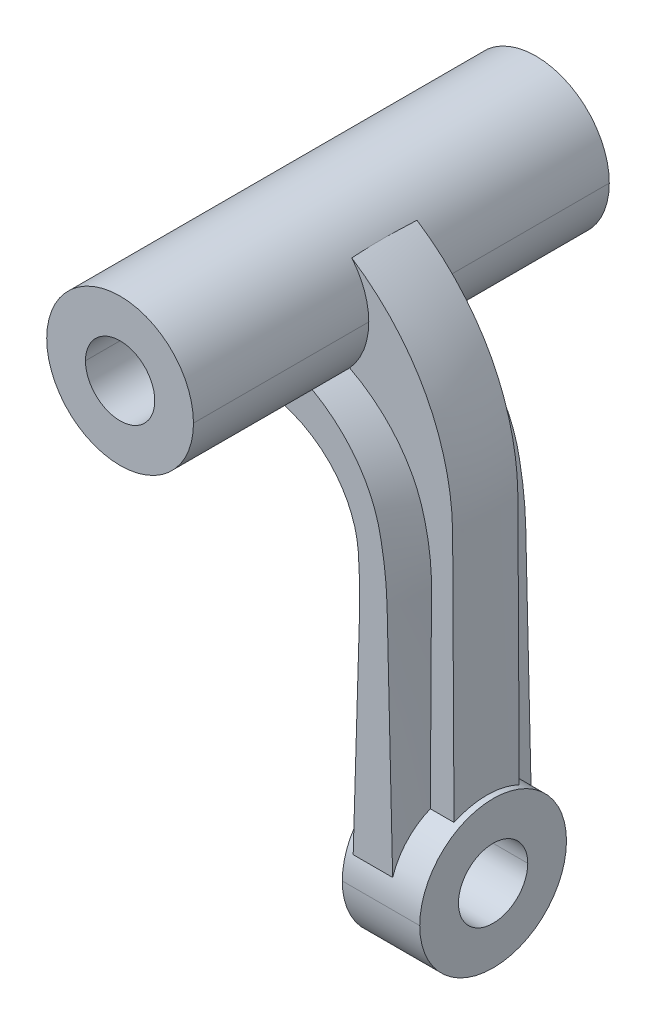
ISO-10303-21;
HEADER;
FILE_DESCRIPTION(('STEP AP214'),'2;1');
FILE_NAME('part.step','',(''),(''),'','','');
FILE_SCHEMA(('AUTOMOTIVE_DESIGN { 1 0 10303 214 1 1 1 1 }'));
ENDSEC;
DATA;
#1=APPLICATION_CONTEXT('core data for automotive mechanical design processes');
#2=APPLICATION_PROTOCOL_DEFINITION('international standard','automotive_design',2000,#1);
#3=PRODUCT_CONTEXT('',#1,'mechanical');
#4=PRODUCT('Part','Part','',(#3));
#5=PRODUCT_RELATED_PRODUCT_CATEGORY('part','',(#4));
#6=PRODUCT_DEFINITION_FORMATION('','',#4);
#7=PRODUCT_DEFINITION_CONTEXT('part definition',#1,'design');
#8=PRODUCT_DEFINITION('design','',#6,#7);
#9=PRODUCT_DEFINITION_SHAPE('','',#8);
#10=(LENGTH_UNIT() NAMED_UNIT(*) SI_UNIT(.MILLI.,.METRE.));
#11=(NAMED_UNIT(*) PLANE_ANGLE_UNIT() SI_UNIT($,.RADIAN.));
#12=(NAMED_UNIT(*) SI_UNIT($,.STERADIAN.) SOLID_ANGLE_UNIT());
#13=UNCERTAINTY_MEASURE_WITH_UNIT(LENGTH_MEASURE(1.E-05),#10,'distance_accuracy_value','');
#14=(GEOMETRIC_REPRESENTATION_CONTEXT(3) GLOBAL_UNCERTAINTY_ASSIGNED_CONTEXT((#13)) GLOBAL_UNIT_ASSIGNED_CONTEXT((#10,
#11,#12)) REPRESENTATION_CONTEXT('',''));
#15=CARTESIAN_POINT('',(0.,0.,0.));
#16=DIRECTION('',(0.,0.,1.));
#17=DIRECTION('',(1.,0.,0.));
#18=AXIS2_PLACEMENT_3D('',#15,#16,#17);
#19=CARTESIAN_POINT('',(-18.001,-112.,0.));
#20=DIRECTION('',(1.,0.,0.));
#21=DIRECTION('',(0.,0.,-1.));
#22=AXIS2_PLACEMENT_3D('',#19,#20,#21);
#23=CYLINDRICAL_SURFACE('',#22,8.5);
#24=DIRECTION('',(1.,0.,0.));
#25=VECTOR('',#24,1.);
#26=CARTESIAN_POINT('',(-18.001,-112.,8.5));
#27=LINE('',#26,#25);
#28=CARTESIAN_POINT('',(21.5,-112.,8.5));
#29=VERTEX_POINT('',#28);
#30=CARTESIAN_POINT('',(40.5,-112.,8.5));
#31=VERTEX_POINT('',#30);
#32=EDGE_CURVE('E459',#29,#31,#27,.T.);
#33=ORIENTED_EDGE('',*,*,#32,.F.);
#34=CARTESIAN_POINT('',(21.5,-112.,0.));
#35=DIRECTION('',(-1.,0.,0.));
#36=DIRECTION('',(0.,0.,-1.));
#37=AXIS2_PLACEMENT_3D('',#34,#35,#36);
#38=CIRCLE('',#37,8.5);
#39=CARTESIAN_POINT('',(21.5,-112.,-8.5));
#40=VERTEX_POINT('',#39);
#41=EDGE_CURVE('E11',#29,#40,#38,.T.);
#42=ORIENTED_EDGE('',*,*,#41,.T.);
#43=DIRECTION('',(1.,0.,0.));
#44=VECTOR('',#43,1.);
#45=CARTESIAN_POINT('',(-18.001,-112.,-8.5));
#46=LINE('',#45,#44);
#47=CARTESIAN_POINT('',(40.5,-112.,-8.5));
#48=VERTEX_POINT('',#47);
#49=EDGE_CURVE('E474',#40,#48,#46,.T.);
#50=ORIENTED_EDGE('',*,*,#49,.T.);
#51=CARTESIAN_POINT('',(40.5,-112.,0.));
#52=DIRECTION('',(1.,0.,0.));
#53=DIRECTION('',(0.,0.,-1.));
#54=AXIS2_PLACEMENT_3D('',#51,#52,#53);
#55=CIRCLE('',#54,8.5);
#56=EDGE_CURVE('E29',#48,#31,#55,.T.);
#57=ORIENTED_EDGE('',*,*,#56,.T.);
#58=EDGE_LOOP('',(#33,#42,#50,#57));
#59=FACE_BOUND('',#58,.T.);
#60=ADVANCED_FACE('F17',(#59),#23,.F.);
#61=CARTESIAN_POINT('',(0.,0.,-51.001));
#62=DIRECTION('',(0.,0.,1.));
#63=DIRECTION('',(1.,0.,0.));
#64=AXIS2_PLACEMENT_3D('',#61,#62,#63);
#65=CYLINDRICAL_SURFACE('',#64,8.5);
#66=DIRECTION('',(0.,0.,1.));
#67=VECTOR('',#66,1.);
#68=CARTESIAN_POINT('',(-8.5,0.,-51.001));
#69=LINE('',#68,#67);
#70=CARTESIAN_POINT('',(-8.5,0.,-51.));
#71=VERTEX_POINT('',#70);
#72=CARTESIAN_POINT('',(-8.5,0.,51.));
#73=VERTEX_POINT('',#72);
#74=EDGE_CURVE('E499',#71,#73,#69,.T.);
#75=ORIENTED_EDGE('',*,*,#74,.F.);
#76=CARTESIAN_POINT('',(0.,0.,-51.));
#77=DIRECTION('',(0.,0.,-1.));
#78=DIRECTION('',(1.,0.,0.));
#79=AXIS2_PLACEMENT_3D('',#76,#77,#78);
#80=CIRCLE('',#79,8.5);
#81=CARTESIAN_POINT('',(8.5,0.,-51.));
#82=VERTEX_POINT('',#81);
#83=EDGE_CURVE('E491',#71,#82,#80,.T.);
#84=ORIENTED_EDGE('',*,*,#83,.T.);
#85=DIRECTION('',(0.,0.,1.));
#86=VECTOR('',#85,1.);
#87=CARTESIAN_POINT('',(8.5,0.,-51.001));
#88=LINE('',#87,#86);
#89=CARTESIAN_POINT('',(8.5,0.,51.));
#90=VERTEX_POINT('',#89);
#91=EDGE_CURVE('E504',#82,#90,#88,.T.);
#92=ORIENTED_EDGE('',*,*,#91,.T.);
#93=CARTESIAN_POINT('',(0.,0.,51.));
#94=DIRECTION('',(0.,0.,1.));
#95=DIRECTION('',(1.,0.,0.));
#96=AXIS2_PLACEMENT_3D('',#93,#94,#95);
#97=CIRCLE('',#96,8.5);
#98=EDGE_CURVE('E495',#90,#73,#97,.T.);
#99=ORIENTED_EDGE('',*,*,#98,.T.);
#100=EDGE_LOOP('',(#75,#84,#92,#99));
#101=FACE_BOUND('',#100,.T.);
#102=ADVANCED_FACE('F441',(#101),#65,.F.);
#103=CARTESIAN_POINT('',(21.5,-112.,0.));
#104=DIRECTION('',(1.,0.,0.));
#105=DIRECTION('',(0.,1.,0.));
#106=AXIS2_PLACEMENT_3D('',#103,#104,#105);
#107=PLANE('',#106);
#108=CARTESIAN_POINT('',(21.5,-112.,0.));
#109=DIRECTION('',(-1.,0.,0.));
#110=DIRECTION('',(0.,0.,-1.));
#111=AXIS2_PLACEMENT_3D('',#108,#109,#110);
#112=CIRCLE('',#111,8.5);
#113=EDGE_CURVE('E471',#40,#29,#112,.T.);
#114=ORIENTED_EDGE('',*,*,#113,.F.);
#115=ORIENTED_EDGE('',*,*,#41,.F.);
#116=EDGE_LOOP('',(#114,#115));
#117=FACE_BOUND('',#116,.T.);
#118=CARTESIAN_POINT('',(21.5,-112.,0.));
#119=DIRECTION('',(1.,0.,0.));
#120=DIRECTION('',(0.,0.,-1.));
#121=AXIS2_PLACEMENT_3D('',#118,#119,#120);
#122=CIRCLE('',#121,18.);
#123=CARTESIAN_POINT('',(21.5,-112.,18.));
#124=VERTEX_POINT('',#123);
#125=CARTESIAN_POINT('',(21.5,-112.,-18.));
#126=VERTEX_POINT('',#125);
#127=EDGE_CURVE('E568',#124,#126,#122,.T.);
#128=ORIENTED_EDGE('',*,*,#127,.F.);
#129=CARTESIAN_POINT('',(21.5,-112.,0.));
#130=DIRECTION('',(1.,0.,0.));
#131=DIRECTION('',(0.,0.,-1.));
#132=AXIS2_PLACEMENT_3D('',#129,#130,#131);
#133=CIRCLE('',#132,18.);
#134=EDGE_CURVE('E482',#126,#124,#133,.T.);
#135=ORIENTED_EDGE('',*,*,#134,.F.);
#136=EDGE_LOOP('',(#128,#135));
#137=FACE_BOUND('',#136,.T.);
#138=ADVANCED_FACE('F438',(#117,#137),#107,.F.);
#139=CARTESIAN_POINT('',(40.5,-112.,0.));
#140=DIRECTION('',(1.,0.,0.));
#141=DIRECTION('',(0.,1.,0.));
#142=AXIS2_PLACEMENT_3D('',#139,#140,#141);
#143=PLANE('',#142);
#144=ORIENTED_EDGE('',*,*,#56,.F.);
#145=CARTESIAN_POINT('',(40.5,-112.,0.));
#146=DIRECTION('',(1.,0.,0.));
#147=DIRECTION('',(0.,0.,-1.));
#148=AXIS2_PLACEMENT_3D('',#145,#146,#147);
#149=CIRCLE('',#148,8.5);
#150=EDGE_CURVE('E470',#31,#48,#149,.T.);
#151=ORIENTED_EDGE('',*,*,#150,.F.);
#152=EDGE_LOOP('',(#144,#151));
#153=FACE_BOUND('',#152,.T.);
#154=CARTESIAN_POINT('',(40.5,-112.,0.));
#155=DIRECTION('',(1.,0.,0.));
#156=DIRECTION('',(0.,0.,-1.));
#157=AXIS2_PLACEMENT_3D('',#154,#155,#156);
#158=CIRCLE('',#157,18.);
#159=CARTESIAN_POINT('',(40.5,-112.,18.));
#160=VERTEX_POINT('',#159);
#161=CARTESIAN_POINT('',(40.5,-112.,-18.));
#162=VERTEX_POINT('',#161);
#163=EDGE_CURVE('E494',#160,#162,#158,.T.);
#164=ORIENTED_EDGE('',*,*,#163,.T.);
#165=CARTESIAN_POINT('',(40.5,-112.,0.));
#166=DIRECTION('',(1.,0.,0.));
#167=DIRECTION('',(0.,0.,-1.));
#168=AXIS2_PLACEMENT_3D('',#165,#166,#167);
#169=CIRCLE('',#168,18.);
#170=EDGE_CURVE('E508',#162,#160,#169,.T.);
#171=ORIENTED_EDGE('',*,*,#170,.T.);
#172=EDGE_LOOP('',(#164,#171));
#173=FACE_BOUND('',#172,.T.);
#174=ADVANCED_FACE('F435',(#153,#173),#143,.T.);
#175=CARTESIAN_POINT('',(40.5,-112.,0.));
#176=DIRECTION('',(-1.,0.,0.));
#177=DIRECTION('',(0.,0.,1.));
#178=AXIS2_PLACEMENT_3D('',#175,#176,#177);
#179=CYLINDRICAL_SURFACE('',#178,18.);
#180=DIRECTION('',(-1.,0.,0.));
#181=VECTOR('',#180,1.);
#182=CARTESIAN_POINT('',(40.5,-112.,-18.));
#183=LINE('',#182,#181);
#184=EDGE_CURVE('E486',#162,#126,#183,.T.);
#185=ORIENTED_EDGE('',*,*,#184,.F.);
#186=ORIENTED_EDGE('',*,*,#163,.F.);
#187=DIRECTION('',(-1.,0.,0.));
#188=VECTOR('',#187,1.);
#189=CARTESIAN_POINT('',(40.5,-112.,18.));
#190=LINE('',#189,#188);
#191=EDGE_CURVE('E485',#160,#124,#190,.T.);
#192=ORIENTED_EDGE('',*,*,#191,.T.);
#193=ORIENTED_EDGE('',*,*,#127,.T.);
#194=EDGE_LOOP('',(#185,#186,#192,#193));
#195=FACE_BOUND('',#194,.T.);
#196=ADVANCED_FACE('F431',(#195),#179,.T.);
#197=CARTESIAN_POINT('',(0.,0.,-51.));
#198=DIRECTION('',(0.,0.,1.));
#199=DIRECTION('',(1.,0.,0.));
#200=AXIS2_PLACEMENT_3D('',#197,#198,#199);
#201=PLANE('',#200);
#202=CARTESIAN_POINT('',(0.,0.,-51.));
#203=DIRECTION('',(0.,0.,-1.));
#204=DIRECTION('',(1.,0.,0.));
#205=AXIS2_PLACEMENT_3D('',#202,#203,#204);
#206=CIRCLE('',#205,8.5);
#207=EDGE_CURVE('E490',#82,#71,#206,.T.);
#208=ORIENTED_EDGE('',*,*,#207,.F.);
#209=ORIENTED_EDGE('',*,*,#83,.F.);
#210=EDGE_LOOP('',(#208,#209));
#211=FACE_BOUND('',#210,.T.);
#212=CARTESIAN_POINT('',(0.,0.,-51.));
#213=DIRECTION('',(0.,0.,1.));
#214=DIRECTION('',(1.,0.,0.));
#215=AXIS2_PLACEMENT_3D('',#212,#213,#214);
#216=CIRCLE('',#215,18.);
#217=CARTESIAN_POINT('',(-18.,0.,-51.));
#218=VERTEX_POINT('',#217);
#219=CARTESIAN_POINT('',(18.,0.,-51.));
#220=VERTEX_POINT('',#219);
#221=EDGE_CURVE('E525',#218,#220,#216,.T.);
#222=ORIENTED_EDGE('',*,*,#221,.F.);
#223=CARTESIAN_POINT('',(0.,0.,-51.));
#224=DIRECTION('',(0.,0.,1.));
#225=DIRECTION('',(1.,0.,0.));
#226=AXIS2_PLACEMENT_3D('',#223,#224,#225);
#227=CIRCLE('',#226,18.);
#228=EDGE_CURVE('E527',#220,#218,#227,.T.);
#229=ORIENTED_EDGE('',*,*,#228,.F.);
#230=EDGE_LOOP('',(#222,#229));
#231=FACE_BOUND('',#230,.T.);
#232=ADVANCED_FACE('F428',(#211,#231),#201,.F.);
#233=CARTESIAN_POINT('',(0.,0.,51.));
#234=DIRECTION('',(0.,0.,1.));
#235=DIRECTION('',(1.,0.,0.));
#236=AXIS2_PLACEMENT_3D('',#233,#234,#235);
#237=PLANE('',#236);
#238=ORIENTED_EDGE('',*,*,#98,.F.);
#239=CARTESIAN_POINT('',(0.,0.,51.));
#240=DIRECTION('',(0.,0.,1.));
#241=DIRECTION('',(1.,0.,0.));
#242=AXIS2_PLACEMENT_3D('',#239,#240,#241);
#243=CIRCLE('',#242,8.5);
#244=EDGE_CURVE('E503',#73,#90,#243,.T.);
#245=ORIENTED_EDGE('',*,*,#244,.F.);
#246=EDGE_LOOP('',(#238,#245));
#247=FACE_BOUND('',#246,.T.);
#248=CARTESIAN_POINT('',(0.,0.,51.));
#249=DIRECTION('',(0.,0.,1.));
#250=DIRECTION('',(1.,0.,0.));
#251=AXIS2_PLACEMENT_3D('',#248,#249,#250);
#252=CIRCLE('',#251,18.);
#253=CARTESIAN_POINT('',(-18.,0.,51.));
#254=VERTEX_POINT('',#253);
#255=CARTESIAN_POINT('',(18.,0.,51.));
#256=VERTEX_POINT('',#255);
#257=EDGE_CURVE('E514',#254,#256,#252,.T.);
#258=ORIENTED_EDGE('',*,*,#257,.T.);
#259=CARTESIAN_POINT('',(0.,0.,51.));
#260=DIRECTION('',(0.,0.,1.));
#261=DIRECTION('',(1.,0.,0.));
#262=AXIS2_PLACEMENT_3D('',#259,#260,#261);
#263=CIRCLE('',#262,18.);
#264=EDGE_CURVE('E372',#256,#254,#263,.T.);
#265=ORIENTED_EDGE('',*,*,#264,.T.);
#266=EDGE_LOOP('',(#258,#265));
#267=FACE_BOUND('',#266,.T.);
#268=ADVANCED_FACE('F418',(#247,#267),#237,.T.);
#269=CARTESIAN_POINT('',(0.,0.,51.));
#270=DIRECTION('',(0.,0.,-1.));
#271=DIRECTION('',(-1.,0.,0.));
#272=AXIS2_PLACEMENT_3D('',#269,#270,#271);
#273=CYLINDRICAL_SURFACE('',#272,18.);
#274=DIRECTION('',(0.,0.,-1.));
#275=VECTOR('',#274,1.);
#276=CARTESIAN_POINT('',(18.,0.,51.));
#277=LINE('',#276,#275);
#278=CARTESIAN_POINT('',(18.,0.,8.));
#279=VERTEX_POINT('',#278);
#280=EDGE_CURVE('E379',#256,#279,#277,.T.);
#281=ORIENTED_EDGE('',*,*,#280,.F.);
#282=ORIENTED_EDGE('',*,*,#257,.F.);
#283=DIRECTION('',(0.,0.,-1.));
#284=VECTOR('',#283,1.);
#285=CARTESIAN_POINT('',(-18.,0.,51.));
#286=LINE('',#285,#284);
#287=EDGE_CURVE('E531',#254,#218,#286,.T.);
#288=ORIENTED_EDGE('',*,*,#287,.T.);
#289=ORIENTED_EDGE('',*,*,#221,.T.);
#290=DIRECTION('',(0.,0.,-1.));
#291=VECTOR('',#290,1.);
#292=CARTESIAN_POINT('',(18.,0.,51.));
#293=LINE('',#292,#291);
#294=CARTESIAN_POINT('',(18.,0.,-8.));
#295=VERTEX_POINT('',#294);
#296=EDGE_CURVE('E532',#295,#220,#293,.T.);
#297=ORIENTED_EDGE('',*,*,#296,.F.);
#298=CARTESIAN_POINT('',(0.,0.,-8.));
#299=DIRECTION('',(0.,0.,1.));
#300=DIRECTION('',(-1.,0.,0.));
#301=AXIS2_PLACEMENT_3D('',#298,#299,#300);
#302=CIRCLE('',#301,18.);
#303=CARTESIAN_POINT('',(13.3125179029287,-12.1151503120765,-8.));
#304=VERTEX_POINT('',#303);
#305=EDGE_CURVE('E175',#304,#295,#302,.T.);
#306=ORIENTED_EDGE('',*,*,#305,.F.);
#307=CARTESIAN_POINT('',(13.1360882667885,-12.3062254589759,-17.));
#308=CARTESIAN_POINT('',(13.1520011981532,-12.2892394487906,-16.2285751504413));
#309=CARTESIAN_POINT('',(13.1678335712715,-12.2722731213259,-15.4571481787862));
#310=CARTESIAN_POINT('',(13.1834862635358,-12.2554351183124,-14.6857147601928));
#311=CARTESIAN_POINT('',(13.1991389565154,-12.2385971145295,-13.9142813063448));
#312=CARTESIAN_POINT('',(13.2146119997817,-12.221887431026,-13.1428413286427));
#313=CARTESIAN_POINT('',(13.229814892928,-12.2054085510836,-12.3713911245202));
#314=CARTESIAN_POINT('',(13.25852955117,-12.1742838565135,-10.9143047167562));
#315=CARTESIAN_POINT('',(13.2862750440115,-12.1439868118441,-9.45718010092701));
#316=CARTESIAN_POINT('',(13.3125179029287,-12.1151503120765,-8.));
#317=(BOUNDED_CURVE() B_SPLINE_CURVE(3,(#307,#308,#309,#310,#311,#312,#313,#314,#315,#316),
.UNSPECIFIED.,.F.,.F.) B_SPLINE_CURVE_WITH_KNOTS((4,3,3,4),(0.,0.00231532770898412,
0.00463065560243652,0.00900376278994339),
.UNSPECIFIED.) CURVE() GEOMETRIC_REPRESENTATION_ITEM() RATIONAL_B_SPLINE_CURVE((1.,1.,1.,1.,1.,
1.,1.,1.,1.,1.)) REPRESENTATION_ITEM(''));
#318=CARTESIAN_POINT('',(13.1360882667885,-12.3062254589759,-17.));
#319=VERTEX_POINT('',#318);
#320=EDGE_CURVE('E182',#319,#304,#317,.T.);
#321=ORIENTED_EDGE('',*,*,#320,.F.);
#322=CARTESIAN_POINT('',(0.,0.,-17.));
#323=DIRECTION('',(0.,0.,1.));
#324=DIRECTION('',(-1.,0.,0.));
#325=AXIS2_PLACEMENT_3D('',#322,#323,#324);
#326=CIRCLE('',#325,18.);
#327=CARTESIAN_POINT('',(1.04083408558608E-13,-18.0000000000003,-17.));
#328=VERTEX_POINT('',#327);
#329=EDGE_CURVE('E364',#328,#319,#326,.T.);
#330=ORIENTED_EDGE('',*,*,#329,.F.);
#331=DIRECTION('',(0.,0.,-1.));
#332=VECTOR('',#331,1.);
#333=CARTESIAN_POINT('',(1.04083408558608E-13,-18.0000000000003,-17.));
#334=LINE('',#333,#332);
#335=CARTESIAN_POINT('',(0.,-18.0000000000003,17.));
#336=VERTEX_POINT('',#335);
#337=EDGE_CURVE('E163',#336,#328,#334,.T.);
#338=ORIENTED_EDGE('',*,*,#337,.F.);
#339=CARTESIAN_POINT('',(0.,0.,17.));
#340=DIRECTION('',(0.,0.,-1.));
#341=DIRECTION('',(1.,0.,0.));
#342=AXIS2_PLACEMENT_3D('',#339,#340,#341);
#343=CIRCLE('',#342,18.);
#344=CARTESIAN_POINT('',(13.1360882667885,-12.3062254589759,17.));
#345=VERTEX_POINT('',#344);
#346=EDGE_CURVE('E43',#345,#336,#343,.T.);
#347=ORIENTED_EDGE('',*,*,#346,.F.);
#348=CARTESIAN_POINT('',(13.3125179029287,-12.1151503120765,8.));
#349=CARTESIAN_POINT('',(13.2986236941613,-12.1304177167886,8.77149995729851));
#350=CARTESIAN_POINT('',(13.2843098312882,-12.1460933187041,9.54298441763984));
#351=CARTESIAN_POINT('',(13.2696522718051,-12.162085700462,10.3144555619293));
#352=CARTESIAN_POINT('',(13.2549947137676,-12.1780780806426,11.0859266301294));
#353=CARTESIAN_POINT('',(13.2399933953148,-12.1943872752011,11.8573846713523));
#354=CARTESIAN_POINT('',(13.224731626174,-12.2109161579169,12.6288327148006));
#355=CARTESIAN_POINT('',(13.1959057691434,-12.2421352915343,14.0859148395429));
#356=CARTESIAN_POINT('',(13.1661440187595,-12.2741429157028,15.54296148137));
#357=CARTESIAN_POINT('',(13.1360882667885,-12.3062254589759,17.));
#358=(BOUNDED_CURVE() B_SPLINE_CURVE(3,(#348,#349,#350,#351,#352,#353,#354,#355,#356,#357),
.UNSPECIFIED.,.F.,.F.) B_SPLINE_CURVE_WITH_KNOTS((4,3,3,4),(0.,0.00231532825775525,
0.00463065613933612,0.00900376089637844),
.UNSPECIFIED.) CURVE() GEOMETRIC_REPRESENTATION_ITEM() RATIONAL_B_SPLINE_CURVE((1.,1.,1.,1.,1.,
1.,1.,1.,1.,1.)) REPRESENTATION_ITEM(''));
#359=CARTESIAN_POINT('',(13.3125179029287,-12.1151503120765,8.));
#360=VERTEX_POINT('',#359);
#361=EDGE_CURVE('E160',#360,#345,#358,.T.);
#362=ORIENTED_EDGE('',*,*,#361,.F.);
#363=CARTESIAN_POINT('',(0.,0.,8.));
#364=DIRECTION('',(0.,0.,-1.));
#365=DIRECTION('',(1.,0.,0.));
#366=AXIS2_PLACEMENT_3D('',#363,#364,#365);
#367=CIRCLE('',#366,18.);
#368=EDGE_CURVE('E166',#279,#360,#367,.T.);
#369=ORIENTED_EDGE('',*,*,#368,.F.);
#370=EDGE_LOOP('',(#281,#282,#288,#289,#297,#306,#321,#330,#338,#347,#362,#369));
#371=FACE_BOUND('',#370,.T.);
#372=ADVANCED_FACE('F159',(#371),#273,.T.);
#373=CARTESIAN_POINT('',(0.,17.9999999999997,8.));
#374=DIRECTION('',(0.,0.,1.));
#375=DIRECTION('',(1.,0.,0.));
#376=AXIS2_PLACEMENT_3D('',#373,#374,#375);
#377=PLANE('',#376);
#378=CARTESIAN_POINT('',(13.3125179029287,-12.1151503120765,8.));
#379=CARTESIAN_POINT('',(22.2079948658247,-16.7300050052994,8.));
#380=CARTESIAN_POINT('',(28.7291452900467,-24.5509869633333,8.));
#381=CARTESIAN_POINT('',(32.7020110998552,-38.5769585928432,8.));
#382=CARTESIAN_POINT('',(33.424715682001,-43.6941377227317,8.));
#383=CARTESIAN_POINT('',(33.2947921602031,-64.5893826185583,8.));
#384=CARTESIAN_POINT('',(33.1975259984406,-80.2324335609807,8.));
#385=CARTESIAN_POINT('',(33.1002598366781,-95.8754845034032,8.));
#386=(BOUNDED_CURVE() B_SPLINE_CURVE(3,(#378,#379,#380,#381,#382,#383,#384,#385),.UNSPECIFIED.,
.F.,.F.) B_SPLINE_CURVE_WITH_KNOTS((4,2,2,4),(0.110248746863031,0.355213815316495,
0.484126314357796,0.868077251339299),
.UNSPECIFIED.) CURVE() GEOMETRIC_REPRESENTATION_ITEM() RATIONAL_B_SPLINE_CURVE((1.,1.,1.,1.,1.,
1.,1.,1.)) REPRESENTATION_ITEM(''));
#387=CARTESIAN_POINT('',(33.1002598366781,-95.8754845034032,8.));
#388=VERTEX_POINT('',#387);
#389=EDGE_CURVE('E173',#360,#388,#386,.T.);
#390=ORIENTED_EDGE('',*,*,#389,.T.);
#391=DIRECTION('',(1.,0.,0.));
#392=VECTOR('',#391,1.);
#393=CARTESIAN_POINT('',(40.5,-95.8754845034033,8.));
#394=LINE('',#393,#392);
#395=CARTESIAN_POINT('',(38.9116599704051,-95.8754845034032,8.));
#396=VERTEX_POINT('',#395);
#397=EDGE_CURVE('E210',#388,#396,#394,.T.);
#398=ORIENTED_EDGE('',*,*,#397,.T.);
#399=CARTESIAN_POINT('',(13.8298527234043,11.5210751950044,8.));
#400=CARTESIAN_POINT('',(23.8976414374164,4.92164636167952,8.));
#401=CARTESIAN_POINT('',(31.5145142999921,-4.88245497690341,8.));
#402=CARTESIAN_POINT('',(37.4407269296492,-22.0875058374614,8.));
#403=CARTESIAN_POINT('',(38.5416072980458,-28.3305665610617,8.));
#404=CARTESIAN_POINT('',(38.6884560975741,-55.134561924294,8.));
#405=CARTESIAN_POINT('',(38.8000580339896,-75.5050232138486,8.));
#406=CARTESIAN_POINT('',(38.9116599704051,-95.8754845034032,8.));
#407=(BOUNDED_CURVE() B_SPLINE_CURVE(3,(#399,#400,#401,#402,#403,#404,#405,#406),.UNSPECIFIED.,
.F.,.F.) B_SPLINE_CURVE_WITH_KNOTS((4,2,2,4),(0.104768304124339,0.355213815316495,
0.484126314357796,0.892301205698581),
.UNSPECIFIED.) CURVE() GEOMETRIC_REPRESENTATION_ITEM() RATIONAL_B_SPLINE_CURVE((1.,1.,1.,1.,1.,
1.,1.,1.)) REPRESENTATION_ITEM(''));
#408=CARTESIAN_POINT('',(13.8298527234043,11.5210751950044,8.));
#409=VERTEX_POINT('',#408);
#410=EDGE_CURVE('E543',#409,#396,#407,.T.);
#411=ORIENTED_EDGE('',*,*,#410,.F.);
#412=CARTESIAN_POINT('',(0.,0.,8.));
#413=DIRECTION('',(0.,0.,-1.));
#414=DIRECTION('',(1.,0.,0.));
#415=AXIS2_PLACEMENT_3D('',#412,#413,#414);
#416=CIRCLE('',#415,18.);
#417=EDGE_CURVE('E536',#409,#279,#416,.T.);
#418=ORIENTED_EDGE('',*,*,#417,.T.);
#419=ORIENTED_EDGE('',*,*,#368,.T.);
#420=EDGE_LOOP('',(#390,#398,#411,#418,#419));
#421=FACE_BOUND('',#420,.T.);
#422=ADVANCED_FACE('F246',(#421),#377,.T.);
#423=CARTESIAN_POINT('',(1.11022302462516E-13,-8.,17.));
#424=DIRECTION('',(0.,0.,1.));
#425=DIRECTION('',(1.,0.,0.));
#426=AXIS2_PLACEMENT_3D('',#423,#424,#425);
#427=PLANE('',#426);
#428=CARTESIAN_POINT('',(0.,-18.0000000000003,17.));
#429=CARTESIAN_POINT('',(13.3090445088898,-18.6113594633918,17.));
#430=CARTESIAN_POINT('',(23.6683856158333,-28.7930947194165,17.));
#431=CARTESIAN_POINT('',(24.7461568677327,-46.019657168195,17.));
#432=CARTESIAN_POINT('',(24.8355978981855,-50.6925148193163,17.));
#433=CARTESIAN_POINT('',(24.1886805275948,-72.2990317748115,17.));
#434=CARTESIAN_POINT('',(23.6829064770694,-89.191475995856,17.));
#435=CARTESIAN_POINT('',(23.177132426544,-106.083920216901,17.));
#436=(BOUNDED_CURVE() B_SPLINE_CURVE(3,(#428,#429,#430,#431,#432,#433,#434,#435),.UNSPECIFIED.,
.F.,.F.) B_SPLINE_CURVE_WITH_KNOTS((4,2,2,4),(0.,0.355213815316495,0.484126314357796,
0.9460723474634),
.UNSPECIFIED.) CURVE() GEOMETRIC_REPRESENTATION_ITEM() RATIONAL_B_SPLINE_CURVE((1.,1.,1.,1.,1.,
1.,1.,1.)) REPRESENTATION_ITEM(''));
#437=CARTESIAN_POINT('',(23.177132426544,-106.083920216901,17.));
#438=VERTEX_POINT('',#437);
#439=EDGE_CURVE('E388',#336,#438,#436,.T.);
#440=ORIENTED_EDGE('',*,*,#439,.T.);
#441=DIRECTION('',(1.,0.,0.));
#442=VECTOR('',#441,1.);
#443=CARTESIAN_POINT('',(40.5,-106.083920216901,17.));
#444=LINE('',#443,#442);
#445=CARTESIAN_POINT('',(32.8587032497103,-106.083920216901,17.));
#446=VERTEX_POINT('',#445);
#447=EDGE_CURVE('E179',#438,#446,#444,.T.);
#448=ORIENTED_EDGE('',*,*,#447,.T.);
#449=CARTESIAN_POINT('',(13.1360882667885,-12.3062254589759,17.));
#450=CARTESIAN_POINT('',(21.6089993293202,-17.0601045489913,17.));
#451=CARTESIAN_POINT('',(27.7329323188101,-25.0806809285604,17.));
#452=CARTESIAN_POINT('',(30.7617368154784,-39.2724801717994,17.));
#453=CARTESIAN_POINT('',(31.3850573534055,-44.382524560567,17.));
#454=CARTESIAN_POINT('',(31.9590570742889,-68.4158313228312,17.));
#455=CARTESIAN_POINT('',(32.4088801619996,-87.2498757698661,17.));
#456=CARTESIAN_POINT('',(32.8587032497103,-106.083920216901,17.));
#457=(BOUNDED_CURVE() B_SPLINE_CURVE(3,(#449,#450,#451,#452,#453,#454,#455,#456),.UNSPECIFIED.,
.F.,.F.) B_SPLINE_CURVE_WITH_KNOTS((4,2,2,4),(0.112603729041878,0.355213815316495,
0.484126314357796,0.951104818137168),
.UNSPECIFIED.) CURVE() GEOMETRIC_REPRESENTATION_ITEM() RATIONAL_B_SPLINE_CURVE((1.,1.,1.,1.,1.,
1.,1.,1.)) REPRESENTATION_ITEM(''));
#458=EDGE_CURVE('E171',#345,#446,#457,.T.);
#459=ORIENTED_EDGE('',*,*,#458,.F.);
#460=ORIENTED_EDGE('',*,*,#346,.T.);
#461=EDGE_LOOP('',(#440,#448,#459,#460));
#462=FACE_BOUND('',#461,.T.);
#463=ADVANCED_FACE('F177',(#462),#427,.T.);
#464=CARTESIAN_POINT('',(1.04083408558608E-13,-18.0000000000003,17.));
#465=CARTESIAN_POINT('',(13.3090445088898,-18.6113594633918,17.));
#466=CARTESIAN_POINT('',(23.6683856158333,-28.7930947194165,17.));
#467=CARTESIAN_POINT('',(24.7461568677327,-46.019657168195,17.));
#468=CARTESIAN_POINT('',(24.8355978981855,-50.6925148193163,17.));
#469=CARTESIAN_POINT('',(24.1296363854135,-74.271058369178,17.));
#470=CARTESIAN_POINT('',(23.5648181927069,-93.1355291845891,17.));
#471=CARTESIAN_POINT('',(23.,-112.,17.));
#472=CARTESIAN_POINT('',(1.04083408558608E-13,-18.0000000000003,15.5833333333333));
#473=CARTESIAN_POINT('',(13.2413266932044,-18.6002784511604,15.5833333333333));
#474=CARTESIAN_POINT('',(23.5704189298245,-28.8411501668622,15.5833333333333));
#475=CARTESIAN_POINT('',(24.4902189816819,-46.1114020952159,15.5833333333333));
#476=CARTESIAN_POINT('',(24.5665504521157,-50.7833186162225,15.5833333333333));
#477=CARTESIAN_POINT('',(23.9640632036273,-74.3269394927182,15.5833333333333));
#478=CARTESIAN_POINT('',(23.4820316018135,-93.1634697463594,15.5833333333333));
#479=CARTESIAN_POINT('',(23.,-112.,15.5833333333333));
#480=CARTESIAN_POINT('',(0.,-18.0000000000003,12.75));
#481=CARTESIAN_POINT('',(13.1158575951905,-18.5797473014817,12.75));
#482=CARTESIAN_POINT('',(23.3889040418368,-28.9301883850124,12.75));
#483=CARTESIAN_POINT('',(24.0160114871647,-46.2813891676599,12.75));
#484=CARTESIAN_POINT('',(24.0680532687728,-50.9515619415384,12.75));
#485=CARTESIAN_POINT('',(23.6572854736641,-74.4304773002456,12.75));
#486=CARTESIAN_POINT('',(23.3286427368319,-93.215238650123,12.75));
#487=CARTESIAN_POINT('',(23.,-112.,12.75));
#488=CARTESIAN_POINT('',(1.11022302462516E-13,-18.0000000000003,8.5));
#489=CARTESIAN_POINT('',(12.9679979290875,-18.5555522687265,8.5));
#490=CARTESIAN_POINT('',(23.1749969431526,-29.0351159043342,8.5));
#491=CARTESIAN_POINT('',(23.457179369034,-46.4817112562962,8.5));
#492=CARTESIAN_POINT('',(23.4805968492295,-51.1498291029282,8.5));
#493=CARTESIAN_POINT('',(23.2957617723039,-74.5524919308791,8.5));
#494=CARTESIAN_POINT('',(23.147880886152,-93.2762459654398,8.5));
#495=CARTESIAN_POINT('',(23.,-112.,8.5));
#496=CARTESIAN_POINT('',(0.,-18.0000000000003,4.25));
#497=CARTESIAN_POINT('',(12.8709266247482,-18.5396679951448,4.25));
#498=CARTESIAN_POINT('',(23.0345648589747,-29.1040018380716,4.25));
#499=CARTESIAN_POINT('',(23.0903006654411,-46.6132246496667,4.25));
#500=CARTESIAN_POINT('',(23.0949260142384,-51.2799934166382,4.25));
#501=CARTESIAN_POINT('',(23.0584179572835,-74.632595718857,4.25));
#502=CARTESIAN_POINT('',(23.0292089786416,-93.3162978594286,4.25));
#503=CARTESIAN_POINT('',(23.,-112.,4.25));
#504=CARTESIAN_POINT('',(1.04083408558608E-13,-18.0000000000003,1.41666666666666));
#505=CARTESIAN_POINT('',(12.8470342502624,-18.5357583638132,1.41666666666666));
#506=CARTESIAN_POINT('',(23.,-29.1209568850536,1.41666666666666));
#507=CARTESIAN_POINT('',(23.,-46.6455943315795,1.41666666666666));
#508=CARTESIAN_POINT('',(23.,-51.3120310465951,1.41666666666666));
#509=CARTESIAN_POINT('',(23.,-74.652311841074,1.41666666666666));
#510=CARTESIAN_POINT('',(23.,-93.3261559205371,1.41666666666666));
#511=CARTESIAN_POINT('',(23.,-112.,1.41666666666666));
#512=CARTESIAN_POINT('',(1.04083408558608E-13,-18.0000000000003,-1.41666666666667));
#513=CARTESIAN_POINT('',(12.8470342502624,-18.5357583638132,-1.41666666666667));
#514=CARTESIAN_POINT('',(23.,-29.1209568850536,-1.41666666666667));
#515=CARTESIAN_POINT('',(23.,-46.6455943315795,-1.41666666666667));
#516=CARTESIAN_POINT('',(23.,-51.3120310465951,-1.41666666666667));
#517=CARTESIAN_POINT('',(23.,-74.652311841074,-1.41666666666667));
#518=CARTESIAN_POINT('',(23.,-93.3261559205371,-1.41666666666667));
#519=CARTESIAN_POINT('',(23.,-112.,-1.41666666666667));
#520=CARTESIAN_POINT('',(1.04083408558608E-13,-18.0000000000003,-4.25));
#521=CARTESIAN_POINT('',(12.8709266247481,-18.5396679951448,-4.25));
#522=CARTESIAN_POINT('',(23.0345648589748,-29.1040018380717,-4.25));
#523=CARTESIAN_POINT('',(23.0903006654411,-46.6132246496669,-4.25));
#524=CARTESIAN_POINT('',(23.0949260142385,-51.2799934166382,-4.25));
#525=CARTESIAN_POINT('',(23.0584179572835,-74.6325957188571,-4.25));
#526=CARTESIAN_POINT('',(23.0292089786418,-93.3162978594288,-4.25));
#527=CARTESIAN_POINT('',(23.,-112.,-4.25));
#528=CARTESIAN_POINT('',(1.04083408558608E-13,-18.0000000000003,-8.5));
#529=CARTESIAN_POINT('',(12.9679979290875,-18.5555522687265,-8.5));
#530=CARTESIAN_POINT('',(23.1749969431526,-29.0351159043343,-8.5));
#531=CARTESIAN_POINT('',(23.4571793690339,-46.4817112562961,-8.5));
#532=CARTESIAN_POINT('',(23.4805968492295,-51.1498291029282,-8.5));
#533=CARTESIAN_POINT('',(23.2957617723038,-74.552491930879,-8.5));
#534=CARTESIAN_POINT('',(23.147880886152,-93.2762459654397,-8.5));
#535=CARTESIAN_POINT('',(23.,-112.,-8.5));
#536=CARTESIAN_POINT('',(1.11022302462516E-13,-18.0000000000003,-12.75));
#537=CARTESIAN_POINT('',(13.1158575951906,-18.5797473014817,-12.75));
#538=CARTESIAN_POINT('',(23.3889040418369,-28.9301883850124,-12.75));
#539=CARTESIAN_POINT('',(24.0160114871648,-46.2813891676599,-12.75));
#540=CARTESIAN_POINT('',(24.0680532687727,-50.9515619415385,-12.75));
#541=CARTESIAN_POINT('',(23.6572854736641,-74.4304773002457,-12.75));
#542=CARTESIAN_POINT('',(23.328642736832,-93.2152386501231,-12.75));
#543=CARTESIAN_POINT('',(23.,-112.,-12.75));
#544=CARTESIAN_POINT('',(1.04083408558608E-13,-18.0000000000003,-15.5833333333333));
#545=CARTESIAN_POINT('',(13.2413266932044,-18.6002784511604,-15.5833333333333));
#546=CARTESIAN_POINT('',(23.5704189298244,-28.8411501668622,-15.5833333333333));
#547=CARTESIAN_POINT('',(24.4902189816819,-46.1114020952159,-15.5833333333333));
#548=CARTESIAN_POINT('',(24.5665504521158,-50.7833186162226,-15.5833333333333));
#549=CARTESIAN_POINT('',(23.9640632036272,-74.3269394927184,-15.5833333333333));
#550=CARTESIAN_POINT('',(23.4820316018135,-93.1634697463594,-15.5833333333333));
#551=CARTESIAN_POINT('',(23.,-112.,-15.5833333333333));
#552=CARTESIAN_POINT('',(1.04083408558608E-13,-18.0000000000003,-17.));
#553=CARTESIAN_POINT('',(13.3090445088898,-18.6113594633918,-17.));
#554=CARTESIAN_POINT('',(23.6683856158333,-28.7930947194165,-17.));
#555=CARTESIAN_POINT('',(24.7461568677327,-46.0196571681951,-17.));
#556=CARTESIAN_POINT('',(24.8355978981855,-50.6925148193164,-17.));
#557=CARTESIAN_POINT('',(24.1296363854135,-74.2710583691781,-17.));
#558=CARTESIAN_POINT('',(23.5648181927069,-93.1355291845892,-17.));
#559=CARTESIAN_POINT('',(23.,-112.,-17.));
#560=(BOUNDED_SURFACE() B_SPLINE_SURFACE(3,3,((#464,#465,#466,#467,#468,#469,#470,#471),(#472,
#473,#474,#475,#476,#477,#478,#479),(#480,#481,#482,#483,#484,#485,#486,#487),(#488,#489,#490,
#491,#492,#493,#494,#495),(#496,#497,#498,#499,#500,#501,#502,#503),(#504,#505,#506,#507,#508,
#509,#510,#511),(#512,#513,#514,#515,#516,#517,#518,#519),(#520,#521,#522,#523,#524,#525,#526,
#527),(#528,#529,#530,#531,#532,#533,#534,#535),(#536,#537,#538,#539,#540,#541,#542,#543),(#544,
#545,#546,#547,#548,#549,#550,#551),(#552,#553,#554,#555,#556,#557,#558,#559)),.UNSPECIFIED.,
.F.,.F.,.F.) B_SPLINE_SURFACE_WITH_KNOTS((4,1,1,1,2,1,1,1,4),(4,2,2,4),(0.285714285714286,
0.322142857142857,0.358571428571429,0.395,0.431428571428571,0.467857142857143,0.504285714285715,
0.540714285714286,0.577142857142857),(0.,0.355213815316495,0.484126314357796,1.),
.UNSPECIFIED.) GEOMETRIC_REPRESENTATION_ITEM() RATIONAL_B_SPLINE_SURFACE(((1.,1.,1.,1.,1.,1.,1.,
1.),(1.,1.,1.,1.,1.,1.,1.,1.),(1.,1.,1.,1.,1.,1.,1.,1.),(1.,1.,1.,1.,1.,1.,1.,1.),(1.,1.,1.,1.,
1.,1.,1.,1.),(1.,1.,1.,1.,1.,1.,1.,1.),(1.,1.,1.,1.,1.,1.,1.,1.),(1.,1.,1.,1.,1.,1.,1.,1.),(1.,
1.,1.,1.,1.,1.,1.,1.),(1.,1.,1.,1.,1.,1.,1.,1.),(1.,1.,1.,1.,1.,1.,1.,1.),(1.,1.,1.,1.,1.,1.,1.,1.))) REPRESENTATION_ITEM('') SURFACE());
#561=CARTESIAN_POINT('',(1.04083408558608E-13,-18.0000000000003,-17.));
#562=CARTESIAN_POINT('',(13.3090445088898,-18.6113594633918,-17.));
#563=CARTESIAN_POINT('',(23.6683856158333,-28.7930947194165,-17.));
#564=CARTESIAN_POINT('',(24.7461568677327,-46.0196571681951,-17.));
#565=CARTESIAN_POINT('',(24.8355978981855,-50.6925148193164,-17.));
#566=CARTESIAN_POINT('',(24.1886805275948,-72.2990317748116,-17.));
#567=CARTESIAN_POINT('',(23.6829064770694,-89.1914759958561,-17.));
#568=CARTESIAN_POINT('',(23.1771324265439,-106.083920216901,-17.));
#569=(BOUNDED_CURVE() B_SPLINE_CURVE(3,(#561,#562,#563,#564,#565,#566,#567,#568),.UNSPECIFIED.,
.F.,.F.) B_SPLINE_CURVE_WITH_KNOTS((4,2,2,4),(0.,0.355213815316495,0.484126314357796,
0.946072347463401),
.UNSPECIFIED.) CURVE() GEOMETRIC_REPRESENTATION_ITEM() RATIONAL_B_SPLINE_CURVE((1.,1.,1.,1.,1.,
1.,1.,1.)) REPRESENTATION_ITEM(''));
#570=CARTESIAN_POINT('',(23.1771324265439,-106.083920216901,-17.));
#571=VERTEX_POINT('',#570);
#572=EDGE_CURVE('E557',#328,#571,#569,.T.);
#573=CARTESIAN_POINT('',(23.1771324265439,-106.0839202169,-17.));
#574=CARTESIAN_POINT('',(23.1823071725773,-105.864956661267,-16.9238095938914));
#575=CARTESIAN_POINT('',(23.187211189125,-105.64745586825,-16.8433933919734));
#576=CARTESIAN_POINT('',(23.1964325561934,-105.216004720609,-16.6743272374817));
#577=CARTESIAN_POINT('',(23.2007506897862,-105.002049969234,-16.5856885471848));
#578=CARTESIAN_POINT('',(23.2087696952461,-104.577700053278,-16.4001790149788));
#579=CARTESIAN_POINT('',(23.2124705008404,-104.367305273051,-16.3033072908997));
#580=CARTESIAN_POINT('',(23.2192304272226,-103.950078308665,-16.1013470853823));
#581=CARTESIAN_POINT('',(23.2222885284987,-103.743252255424,-15.9962459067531));
#582=CARTESIAN_POINT('',(23.2277280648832,-103.334266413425,-15.7784236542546));
#583=CARTESIAN_POINT('',(23.2301110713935,-103.132096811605,-15.6657210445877));
#584=CARTESIAN_POINT('',(23.2341892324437,-102.732546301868,-15.4327613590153));
#585=CARTESIAN_POINT('',(23.2358853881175,-102.535158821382,-15.3125155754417));
#586=CARTESIAN_POINT('',(23.2385860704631,-102.145168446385,-15.06448158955));
#587=CARTESIAN_POINT('',(23.2395905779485,-101.952565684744,-14.9366931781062));
#588=CARTESIAN_POINT('',(23.2409095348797,-101.572137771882,-14.6735858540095));
#589=CARTESIAN_POINT('',(23.2412229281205,-101.384320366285,-14.5382557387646));
#590=CARTESIAN_POINT('',(23.2411666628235,-101.013178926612,-14.2598685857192));
#591=CARTESIAN_POINT('',(23.2407939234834,-100.829878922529,-14.1167795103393));
#592=CARTESIAN_POINT('',(23.2393745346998,-100.469276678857,-13.823850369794));
#593=CARTESIAN_POINT('',(23.2383290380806,-100.291964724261,-13.6740222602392));
#594=CARTESIAN_POINT('',(23.2355892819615,-99.9433226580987,-13.3676265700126));
#595=CARTESIAN_POINT('',(23.2338951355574,-99.7719915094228,-13.2110601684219));
#596=CARTESIAN_POINT('',(23.2298889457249,-99.4352918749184,-12.8911991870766));
#597=CARTESIAN_POINT('',(23.2275760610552,-99.2699318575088,-12.7278957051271));
#598=CARTESIAN_POINT('',(23.2223886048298,-98.9463810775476,-12.3958277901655));
#599=CARTESIAN_POINT('',(23.2195167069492,-98.7881604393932,-12.2270924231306));
#600=CARTESIAN_POINT('',(23.213256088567,-98.4786589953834,-11.8839872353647));
#601=CARTESIAN_POINT('',(23.2098684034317,-98.3273650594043,-11.7096292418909));
#602=CARTESIAN_POINT('',(23.2026277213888,-98.031690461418,-11.3552892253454));
#603=CARTESIAN_POINT('',(23.1987749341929,-97.8873067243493,-11.1753097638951));
#604=CARTESIAN_POINT('',(23.1906603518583,-97.6054234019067,-10.8097366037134));
#605=CARTESIAN_POINT('',(23.1863981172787,-97.4679314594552,-10.6241370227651));
#606=CARTESIAN_POINT('',(23.1774990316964,-97.1990015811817,-10.2462052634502));
#607=CARTESIAN_POINT('',(23.1728592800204,-97.0676257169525,-10.0538289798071));
#608=CARTESIAN_POINT('',(23.163320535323,-96.812742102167,-9.66456395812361));
#609=CARTESIAN_POINT('',(23.1584221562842,-96.6892171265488,-9.46768648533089));
#610=CARTESIAN_POINT('',(23.1484381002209,-96.4499999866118,-9.06942805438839));
#611=CARTESIAN_POINT('',(23.1433525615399,-96.3343022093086,-8.86805046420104));
#612=CARTESIAN_POINT('',(23.1330690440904,-96.1107018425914,-8.46080019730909));
#613=CARTESIAN_POINT('',(23.1278709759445,-96.0028057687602,-8.25492394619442));
#614=CARTESIAN_POINT('',(23.117478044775,-95.7955373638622,-7.84020874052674));
#615=CARTESIAN_POINT('',(23.1122832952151,-95.6961251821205,-7.63138969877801));
#616=CARTESIAN_POINT('',(23.1019667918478,-95.5056574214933,-7.21057109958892));
#617=CARTESIAN_POINT('',(23.0968448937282,-95.4145825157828,-6.99858029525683));
#618=CARTESIAN_POINT('',(23.0867501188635,-95.2407513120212,-6.57142541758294));
#619=CARTESIAN_POINT('',(23.081777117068,-95.1579878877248,-6.35626424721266));
#620=CARTESIAN_POINT('',(23.0720561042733,-95.0007411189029,-5.92277490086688));
#621=CARTESIAN_POINT('',(23.0673082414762,-94.926263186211,-5.70444475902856));
#622=CARTESIAN_POINT('',(23.0580761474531,-94.7849885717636,-5.2628589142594));
#623=CARTESIAN_POINT('',(23.0535950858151,-94.7182776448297,-5.03957570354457));
#624=CARTESIAN_POINT('',(23.0450392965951,-94.5937281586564,-4.59109603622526));
#625=CARTESIAN_POINT('',(23.0409636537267,-94.5358694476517,-4.36590519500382));
#626=CARTESIAN_POINT('',(23.0332853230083,-94.4289882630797,-3.91361536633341));
#627=CARTESIAN_POINT('',(23.0296822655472,-94.3799588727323,-3.6865180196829));
#628=CARTESIAN_POINT('',(23.0230123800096,-94.2907005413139,-3.23041927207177));
#629=CARTESIAN_POINT('',(23.0199459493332,-94.2504781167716,-3.00141659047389));
#630=CARTESIAN_POINT('',(23.0144308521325,-94.1790893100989,-2.54334022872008));
#631=CARTESIAN_POINT('',(23.011978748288,-94.1478723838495,-2.31427446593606));
#632=CARTESIAN_POINT('',(23.0077267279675,-94.0943462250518,-1.85554524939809));
#633=CARTESIAN_POINT('',(23.0059255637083,-94.0720199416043,-1.62588379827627));
#634=CARTESIAN_POINT('',(23.0030135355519,-94.0362479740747,-1.16596615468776));
#635=CARTESIAN_POINT('',(23.0019023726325,-94.022798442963,-0.935710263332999));
#636=CARTESIAN_POINT('',(23.0004023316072,-94.0047552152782,-0.474605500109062));
#637=CARTESIAN_POINT('',(23.0000142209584,-94.0001709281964,-0.243756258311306));
#638=CARTESIAN_POINT('',(22.9999864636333,-93.9998371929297,0.219516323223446));
#639=CARTESIAN_POINT('',(23.0003519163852,-94.004147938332,0.451939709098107));
#640=CARTESIAN_POINT('',(23.0018176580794,-94.0217691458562,0.916208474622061));
#641=CARTESIAN_POINT('',(23.0029172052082,-94.0350705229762,1.14805420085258));
#642=CARTESIAN_POINT('',(23.0058164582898,-94.0706702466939,1.61116734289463));
#643=CARTESIAN_POINT('',(23.0076165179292,-94.0929731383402,1.84243440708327));
#644=CARTESIAN_POINT('',(23.0118763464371,-94.1465751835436,2.30439109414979));
#645=CARTESIAN_POINT('',(23.0143374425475,-94.1778924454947,2.53507860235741));
#646=CARTESIAN_POINT('',(23.0198421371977,-94.2491225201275,2.99327906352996));
#647=CARTESIAN_POINT('',(23.0228810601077,-94.2889666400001,3.22080275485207));
#648=CARTESIAN_POINT('',(23.0294902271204,-94.3773610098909,3.67399142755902));
#649=CARTESIAN_POINT('',(23.0330601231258,-94.4259055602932,3.89965752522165));
#650=CARTESIAN_POINT('',(23.0406679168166,-94.5317083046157,4.34913272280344));
#651=CARTESIAN_POINT('',(23.0447062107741,-94.5889738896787,4.57294007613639));
#652=CARTESIAN_POINT('',(23.0531846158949,-94.7122274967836,5.01870070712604));
#653=CARTESIAN_POINT('',(23.0576256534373,-94.7782357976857,5.24064835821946));
#654=CARTESIAN_POINT('',(23.0668303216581,-94.9188228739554,5.68218169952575));
#655=CARTESIAN_POINT('',(23.0715944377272,-94.9934146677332,5.90176323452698));
#656=CARTESIAN_POINT('',(23.0813531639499,-95.1509884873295,6.3377441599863));
#657=CARTESIAN_POINT('',(23.0863476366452,-95.2339655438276,6.55414534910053));
#658=CARTESIAN_POINT('',(23.0964894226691,-95.4083227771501,6.98376946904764));
#659=CARTESIAN_POINT('',(23.1016368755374,-95.4997107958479,7.19698921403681));
#660=CARTESIAN_POINT('',(23.1120074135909,-95.6909026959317,7.62025566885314));
#661=CARTESIAN_POINT('',(23.117230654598,-95.7907268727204,7.83029320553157));
#662=CARTESIAN_POINT('',(23.1276288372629,-95.9978591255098,8.2453034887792));
#663=CARTESIAN_POINT('',(23.1328038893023,-96.1051262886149,8.45029665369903));
#664=CARTESIAN_POINT('',(23.1430442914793,-96.3274114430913,8.85584251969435));
#665=CARTESIAN_POINT('',(23.1481097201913,-96.4424236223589,9.05639840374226));
#666=CARTESIAN_POINT('',(23.158057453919,-96.6802109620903,9.45307547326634));
#667=CARTESIAN_POINT('',(23.1629396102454,-96.8029922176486,9.64919300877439));
#668=CARTESIAN_POINT('',(23.1724507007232,-97.0563290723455,10.0370005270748));
#669=CARTESIAN_POINT('',(23.1770790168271,-97.1869021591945,10.2286790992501));
#670=CARTESIAN_POINT('',(23.1859903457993,-97.4550707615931,10.6065373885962));
#671=CARTESIAN_POINT('',(23.190273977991,-97.5926529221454,10.7927265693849));
#672=CARTESIAN_POINT('',(23.1984315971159,-97.8747666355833,11.1594720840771));
#673=CARTESIAN_POINT('',(23.2023059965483,-98.0192909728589,11.3400339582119));
#674=CARTESIAN_POINT('',(23.2095895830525,-98.3152961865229,11.6955325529));
#675=CARTESIAN_POINT('',(23.2129985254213,-98.4667806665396,11.8704662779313));
#676=CARTESIAN_POINT('',(23.2193008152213,-98.7767120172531,12.2147175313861));
#677=CARTESIAN_POINT('',(23.2221930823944,-98.9351726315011,12.3840227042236));
#678=CARTESIAN_POINT('',(23.2274100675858,-99.2586555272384,12.716604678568));
#679=CARTESIAN_POINT('',(23.2297341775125,-99.4236846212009,12.8798748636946));
#680=CARTESIAN_POINT('',(23.233765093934,-99.7597296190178,13.1996994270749));
#681=CARTESIAN_POINT('',(23.2354726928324,-99.930737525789,13.3562621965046));
#682=CARTESIAN_POINT('',(23.2382415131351,-100.27873962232,13.6626814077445));
#683=CARTESIAN_POINT('',(23.2393025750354,-100.455735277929,13.8125361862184));
#684=CARTESIAN_POINT('',(23.2407551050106,-100.815711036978,14.105550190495));
#685=CARTESIAN_POINT('',(23.2411453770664,-100.998701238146,14.2486970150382));
#686=CARTESIAN_POINT('',(23.2412381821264,-101.369212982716,14.5272107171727));
#687=CARTESIAN_POINT('',(23.240943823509,-101.556710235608,14.662609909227));
#688=CARTESIAN_POINT('',(23.239664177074,-101.936512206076,14.9258820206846));
#689=CARTESIAN_POINT('',(23.2386798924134,-102.128809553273,15.0537655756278));
#690=CARTESIAN_POINT('',(23.2360206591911,-102.518202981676,15.3020172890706));
#691=CARTESIAN_POINT('',(23.234345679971,-102.715299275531,15.4223851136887));
#692=CARTESIAN_POINT('',(23.2303106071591,-103.114281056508,15.6556167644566));
#693=CARTESIAN_POINT('',(23.2279494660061,-103.316173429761,15.768468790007));
#694=CARTESIAN_POINT('',(23.2225320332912,-103.726279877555,15.9875009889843));
#695=CARTESIAN_POINT('',(23.2194686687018,-103.93453818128,16.0935981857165));
#696=CARTESIAN_POINT('',(23.2126877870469,-104.354696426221,16.2974305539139));
#697=CARTESIAN_POINT('',(23.2089712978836,-104.566590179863,16.3951785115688));
#698=CARTESIAN_POINT('',(23.2009109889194,-104.994004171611,16.5823217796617));
#699=CARTESIAN_POINT('',(23.1965672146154,-105.209524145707,16.6717176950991));
#700=CARTESIAN_POINT('',(23.1872852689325,-105.64417150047,16.8421800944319));
#701=CARTESIAN_POINT('',(23.1823462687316,-105.863303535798,16.9232346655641));
#702=CARTESIAN_POINT('',(23.1771324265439,-106.0839202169,17.));
#703=B_SPLINE_CURVE_WITH_KNOTS('',3,(#573,#574,#575,#576,#577,#578,#579,#580,#581,#582,#583,
#584,#585,#586,#587,#588,#589,#590,#591,#592,#593,#594,#595,#596,#597,#598,#599,#600,#601,#602,
#603,#604,#605,#606,#607,#608,#609,#610,#611,#612,#613,#614,#615,#616,#617,#618,#619,#620,#621,
#622,#623,#624,#625,#626,#627,#628,#629,#630,#631,#632,#633,#634,#635,#636,#637,#638,#639,#640,
#641,#642,#643,#644,#645,#646,#647,#648,#649,#650,#651,#652,#653,#654,#655,#656,#657,#658,#659,
#660,#661,#662,#663,#664,#665,#666,#667,#668,#669,#670,#671,#672,#673,#674,#675,#676,#677,#678,
#679,#680,#681,#682,#683,#684,#685,#686,#687,#688,#689,#690,#691,#692,#693,#694,#695,#696,#697,
#698,#699,#700,#701,#702),.UNSPECIFIED.,.F.,.F.,(4,2,2,2,2,2,2,2,2,2,2,2,2,2,2,2,2,2,2,2,2,2,2,
2,2,2,2,2,2,2,2,2,2,2,2,2,2,2,2,2,2,2,2,2,2,2,2,2,2,2,2,2,2,2,2,2,2,2,2,2,2,2,2,2,4),(0.,
0.695653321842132,1.39036749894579,2.08515620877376,2.78103886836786,3.47528817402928,
4.16852188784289,4.86177483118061,5.55608651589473,6.2535233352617,6.94976821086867,
7.64589174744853,8.34296659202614,9.03678591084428,9.72923041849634,10.4213638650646,
11.114248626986,11.8130788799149,12.5103188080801,13.2070533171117,13.9043631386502,
14.5981930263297,15.2903714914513,15.9819513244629,16.6739802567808,17.3730421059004,
18.0704880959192,18.7673853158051,19.4647964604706,20.1582135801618,20.8502943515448,
21.542074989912,22.2345894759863,22.9318056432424,23.6283183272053,24.3251831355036,
25.0234577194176,25.7163055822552,26.4087012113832,27.1016869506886,27.7963091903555,
28.4919991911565,29.1872792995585,29.8832143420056,30.580874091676,31.2749635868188,
31.9685378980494,32.6626632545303,33.358409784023,34.0528769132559,34.7466372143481,
35.4407608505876,36.1363191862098,36.8326187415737,37.5280201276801,38.2235930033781,
38.9204048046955,39.6140591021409,40.3067069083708,40.9993854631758,41.693127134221,
42.3941899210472,43.0941590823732,43.7940775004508,44.4949820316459),.UNSPECIFIED.);
#704=EDGE_CURVE('E370',#571,#438,#703,.T.);
#705=ORIENTED_EDGE('',*,*,#572,.T.);
#706=ORIENTED_EDGE('',*,*,#704,.T.);
#707=ORIENTED_EDGE('',*,*,#439,.F.);
#708=ORIENTED_EDGE('',*,*,#337,.T.);
#709=EDGE_LOOP('',(#705,#706,#707,#708));
#710=FACE_BOUND('',#709,.T.);
#711=ADVANCED_FACE('F294',(#710),#560,.T.);
#712=CARTESIAN_POINT('',(1.04083408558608E-13,-18.0000000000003,-17.));
#713=DIRECTION('',(0.,0.,-1.));
#714=DIRECTION('',(0.,-1.,0.));
#715=AXIS2_PLACEMENT_3D('',#712,#713,#714);
#716=PLANE('',#715);
#717=CARTESIAN_POINT('',(13.1360882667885,-12.3062254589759,-17.));
#718=CARTESIAN_POINT('',(21.6089993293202,-17.0601045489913,-17.));
#719=CARTESIAN_POINT('',(27.7329323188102,-25.0806809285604,-17.));
#720=CARTESIAN_POINT('',(30.7617368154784,-39.2724801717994,-17.));
#721=CARTESIAN_POINT('',(31.3850573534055,-44.3825245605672,-17.));
#722=CARTESIAN_POINT('',(31.9590570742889,-68.4158313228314,-17.));
#723=CARTESIAN_POINT('',(32.4088801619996,-87.2498757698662,-17.));
#724=CARTESIAN_POINT('',(32.8587032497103,-106.083920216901,-17.));
#725=(BOUNDED_CURVE() B_SPLINE_CURVE(3,(#717,#718,#719,#720,#721,#722,#723,#724),.UNSPECIFIED.,
.F.,.F.) B_SPLINE_CURVE_WITH_KNOTS((4,2,2,4),(0.112603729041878,0.355213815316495,
0.484126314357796,0.951104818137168),
.UNSPECIFIED.) CURVE() GEOMETRIC_REPRESENTATION_ITEM() RATIONAL_B_SPLINE_CURVE((1.,1.,1.,1.,1.,
1.,1.,1.)) REPRESENTATION_ITEM(''));
#726=CARTESIAN_POINT('',(32.8587032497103,-106.083920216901,-17.));
#727=VERTEX_POINT('',#726);
#728=EDGE_CURVE('E191',#319,#727,#725,.T.);
#729=ORIENTED_EDGE('',*,*,#728,.T.);
#730=DIRECTION('',(-1.,0.,0.));
#731=VECTOR('',#730,1.);
#732=CARTESIAN_POINT('',(40.5,-106.083920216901,-17.));
#733=LINE('',#732,#731);
#734=EDGE_CURVE('E362',#727,#571,#733,.T.);
#735=ORIENTED_EDGE('',*,*,#734,.T.);
#736=ORIENTED_EDGE('',*,*,#572,.F.);
#737=ORIENTED_EDGE('',*,*,#329,.T.);
#738=EDGE_LOOP('',(#729,#735,#736,#737));
#739=FACE_BOUND('',#738,.T.);
#740=ADVANCED_FACE('F360',(#739),#716,.T.);
#741=CARTESIAN_POINT('',(1.11022302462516E-13,-8.,-8.));
#742=DIRECTION('',(0.,0.,-1.));
#743=DIRECTION('',(0.,-1.,0.));
#744=AXIS2_PLACEMENT_3D('',#741,#742,#743);
#745=PLANE('',#744);
#746=CARTESIAN_POINT('',(13.8298527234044,11.5210751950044,-8.));
#747=CARTESIAN_POINT('',(23.8976414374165,4.92164636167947,-8.));
#748=CARTESIAN_POINT('',(31.5145142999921,-4.88245497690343,-8.));
#749=CARTESIAN_POINT('',(37.4407269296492,-22.0875058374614,-8.));
#750=CARTESIAN_POINT('',(38.5416072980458,-28.3305665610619,-8.));
#751=CARTESIAN_POINT('',(38.6884560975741,-55.1345619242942,-8.));
#752=CARTESIAN_POINT('',(38.8000580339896,-75.5050232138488,-8.));
#753=CARTESIAN_POINT('',(38.9116599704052,-95.8754845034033,-8.));
#754=(BOUNDED_CURVE() B_SPLINE_CURVE(3,(#746,#747,#748,#749,#750,#751,#752,#753),.UNSPECIFIED.,
.F.,.F.) B_SPLINE_CURVE_WITH_KNOTS((4,2,2,4),(0.104768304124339,0.355213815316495,
0.484126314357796,0.89230120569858),
.UNSPECIFIED.) CURVE() GEOMETRIC_REPRESENTATION_ITEM() RATIONAL_B_SPLINE_CURVE((1.,1.,1.,1.,1.,
1.,1.,1.)) REPRESENTATION_ITEM(''));
#755=CARTESIAN_POINT('',(13.8298527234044,11.5210751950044,-8.));
#756=VERTEX_POINT('',#755);
#757=CARTESIAN_POINT('',(38.9116599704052,-95.8754845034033,-8.));
#758=VERTEX_POINT('',#757);
#759=EDGE_CURVE('E279',#756,#758,#754,.T.);
#760=ORIENTED_EDGE('',*,*,#759,.T.);
#761=DIRECTION('',(-1.,0.,0.));
#762=VECTOR('',#761,1.);
#763=CARTESIAN_POINT('',(40.5,-95.8754845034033,-8.));
#764=LINE('',#763,#762);
#765=CARTESIAN_POINT('',(33.1002598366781,-95.8754845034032,-8.));
#766=VERTEX_POINT('',#765);
#767=EDGE_CURVE('E311',#758,#766,#764,.T.);
#768=ORIENTED_EDGE('',*,*,#767,.T.);
#769=CARTESIAN_POINT('',(13.3125179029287,-12.1151503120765,-8.));
#770=CARTESIAN_POINT('',(22.2079948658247,-16.7300050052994,-8.));
#771=CARTESIAN_POINT('',(28.7291452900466,-24.5509869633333,-8.));
#772=CARTESIAN_POINT('',(32.7020110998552,-38.5769585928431,-8.));
#773=CARTESIAN_POINT('',(33.424715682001,-43.6941377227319,-8.));
#774=CARTESIAN_POINT('',(33.2947921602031,-64.5893826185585,-8.));
#775=CARTESIAN_POINT('',(33.1975259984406,-80.2324335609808,-8.));
#776=CARTESIAN_POINT('',(33.1002598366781,-95.8754845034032,-8.));
#777=(BOUNDED_CURVE() B_SPLINE_CURVE(3,(#769,#770,#771,#772,#773,#774,#775,#776),.UNSPECIFIED.,
.F.,.F.) B_SPLINE_CURVE_WITH_KNOTS((4,2,2,4),(0.110248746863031,0.355213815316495,
0.484126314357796,0.868077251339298),
.UNSPECIFIED.) CURVE() GEOMETRIC_REPRESENTATION_ITEM() RATIONAL_B_SPLINE_CURVE((1.,1.,1.,1.,1.,
1.,1.,1.)) REPRESENTATION_ITEM(''));
#778=EDGE_CURVE('E340',#304,#766,#777,.T.);
#779=ORIENTED_EDGE('',*,*,#778,.F.);
#780=ORIENTED_EDGE('',*,*,#305,.T.);
#781=CARTESIAN_POINT('',(0.,0.,-8.));
#782=DIRECTION('',(0.,0.,1.));
#783=DIRECTION('',(-1.,0.,0.));
#784=AXIS2_PLACEMENT_3D('',#781,#782,#783);
#785=CIRCLE('',#784,18.);
#786=EDGE_CURVE('E540',#295,#756,#785,.T.);
#787=ORIENTED_EDGE('',*,*,#786,.T.);
#788=EDGE_LOOP('',(#760,#768,#779,#780,#787));
#789=FACE_BOUND('',#788,.T.);
#790=ADVANCED_FACE('F417',(#789),#745,.T.);
#791=CARTESIAN_POINT('',(1.11022302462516E-13,-8.,8.));
#792=CARTESIAN_POINT('',(15.5445610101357,-9.96746299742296,8.));
#793=CARTESIAN_POINT('',(27.5576294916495,-20.4150185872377,8.));
#794=CARTESIAN_POINT('',(32.7020110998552,-38.5769585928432,8.));
#795=CARTESIAN_POINT('',(33.424715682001,-43.6941377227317,8.));
#796=CARTESIAN_POINT('',(33.2613722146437,-69.964221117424,8.));
#797=CARTESIAN_POINT('',(33.1306861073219,-90.9821105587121,8.));
#798=CARTESIAN_POINT('',(33.,-112.,8.));
#799=CARTESIAN_POINT('',(1.11022302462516E-13,-8.,8.75));
#800=CARTESIAN_POINT('',(15.5035402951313,-9.96075056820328,8.75));
#801=CARTESIAN_POINT('',(27.4982852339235,-20.444128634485,8.75));
#802=CARTESIAN_POINT('',(32.5469742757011,-38.6325339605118,8.75));
#803=CARTESIAN_POINT('',(33.2617376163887,-43.7491429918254,8.75));
#804=CARTESIAN_POINT('',(33.1610746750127,-69.9980716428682,8.75));
#805=CARTESIAN_POINT('',(33.0805373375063,-90.9990358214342,8.75));
#806=CARTESIAN_POINT('',(33.,-112.,8.75));
#807=CARTESIAN_POINT('',(1.11022302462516E-13,-8.,10.25));
#808=CARTESIAN_POINT('',(15.4199299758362,-9.94706898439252,10.25));
#809=CARTESIAN_POINT('',(27.3773270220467,-20.5034620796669,10.25));
#810=CARTESIAN_POINT('',(32.2309710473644,-38.7458102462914,10.25));
#811=CARTESIAN_POINT('',(32.9295481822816,-43.8612572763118,10.25));
#812=CARTESIAN_POINT('',(32.9566435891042,-70.0670673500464,10.25));
#813=CARTESIAN_POINT('',(32.9783217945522,-91.0335336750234,10.25));
#814=CARTESIAN_POINT('',(33.,-112.,10.25));
#815=CARTESIAN_POINT('',(1.11022302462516E-13,-8.,12.5));
#816=CARTESIAN_POINT('',(15.2913575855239,-9.92603002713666,12.5));
#817=CARTESIAN_POINT('',(27.1913226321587,-20.5947025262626,12.5));
#818=CARTESIAN_POINT('',(31.7450347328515,-38.9200016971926,12.5));
#819=CARTESIAN_POINT('',(32.418721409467,-44.0336618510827,12.5));
#820=CARTESIAN_POINT('',(32.6422781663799,-70.1731660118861,12.5));
#821=CARTESIAN_POINT('',(32.82113908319,-91.0865830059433,12.5));
#822=CARTESIAN_POINT('',(33.,-112.,12.5));
#823=CARTESIAN_POINT('',(1.11022302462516E-13,-8.,14.75));
#824=CARTESIAN_POINT('',(15.1611780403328,-9.90472808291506,14.75));
#825=CARTESIAN_POINT('',(27.0029931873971,-20.6870834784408,14.75));
#826=CARTESIAN_POINT('',(31.2530242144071,-39.0963705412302,14.75));
#827=CARTESIAN_POINT('',(31.9015093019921,-44.2082214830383,14.75));
#828=CARTESIAN_POINT('',(32.3239831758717,-70.2805909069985,14.75));
#829=CARTESIAN_POINT('',(32.6619915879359,-91.1402954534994,14.75));
#830=CARTESIAN_POINT('',(33.,-112.,14.75));
#831=CARTESIAN_POINT('',(1.11022302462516E-13,-8.,16.25));
#832=CARTESIAN_POINT('',(15.0743534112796,-9.89052052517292,16.25));
#833=CARTESIAN_POINT('',(26.8773848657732,-20.7486979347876,16.25));
#834=CARTESIAN_POINT('',(30.9248725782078,-39.2140016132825,16.25));
#835=CARTESIAN_POINT('',(31.5565491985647,-44.3246458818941,16.25));
#836=CARTESIAN_POINT('',(32.1116929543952,-70.352239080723,16.25));
#837=CARTESIAN_POINT('',(32.5558464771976,-91.1761195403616,16.25));
#838=CARTESIAN_POINT('',(33.,-112.,16.25));
#839=CARTESIAN_POINT('',(1.11022302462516E-13,-8.,17.));
#840=CARTESIAN_POINT('',(15.0311898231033,-9.88345744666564,17.));
#841=CARTESIAN_POINT('',(26.8149405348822,-20.7793286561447,17.));
#842=CARTESIAN_POINT('',(30.7617368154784,-39.2724801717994,17.));
#843=CARTESIAN_POINT('',(31.3850573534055,-44.382524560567,17.));
#844=CARTESIAN_POINT('',(32.0061559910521,-70.3878579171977,17.));
#845=CARTESIAN_POINT('',(32.5030779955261,-91.1939289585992,17.));
#846=CARTESIAN_POINT('',(33.,-112.,17.));
#847=(BOUNDED_SURFACE() B_SPLINE_SURFACE(3,3,((#791,#792,#793,#794,#795,#796,#797,#798),(#799,
#800,#801,#802,#803,#804,#805,#806),(#807,#808,#809,#810,#811,#812,#813,#814),(#815,#816,#817,
#818,#819,#820,#821,#822),(#823,#824,#825,#826,#827,#828,#829,#830),(#831,#832,#833,#834,#835,
#836,#837,#838),(#839,#840,#841,#842,#843,#844,#845,#846)),.UNSPECIFIED.,.F.,.F.,
.F.) B_SPLINE_SURFACE_WITH_KNOTS((4,1,1,1,4),(4,2,2,4),(0.122857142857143,0.142142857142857,
0.161428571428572,0.180714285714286,0.2),(0.,0.355213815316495,0.484126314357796,1.),
.UNSPECIFIED.) GEOMETRIC_REPRESENTATION_ITEM() RATIONAL_B_SPLINE_SURFACE(((1.,1.,1.,1.,1.,1.,1.,
1.),(1.,1.,1.,1.,1.,1.,1.,1.),(1.,1.,1.,1.,1.,1.,1.,1.),(1.,1.,1.,1.,1.,1.,1.,1.),(1.,1.,1.,1.,
1.,1.,1.,1.),(1.,1.,1.,1.,1.,1.,1.,1.),(1.,1.,1.,1.,1.,1.,1.,1.))) REPRESENTATION_ITEM('') SURFACE());
#848=CARTESIAN_POINT('',(32.8587032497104,-106.0839202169,17.));
#849=CARTESIAN_POINT('',(32.8540691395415,-105.809281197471,16.9044501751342));
#850=CARTESIAN_POINT('',(32.8498963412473,-105.536940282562,16.8022607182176));
#851=CARTESIAN_POINT('',(32.842582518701,-104.998254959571,16.5850962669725));
#852=CARTESIAN_POINT('',(32.8394387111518,-104.731896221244,16.470156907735));
#853=CARTESIAN_POINT('',(32.834266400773,-104.20514476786,16.2274972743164));
#854=CARTESIAN_POINT('',(32.8322375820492,-103.944750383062,16.0997806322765));
#855=CARTESIAN_POINT('',(32.829369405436,-103.429886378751,15.8316078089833));
#856=CARTESIAN_POINT('',(32.8285326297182,-103.175430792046,15.6911246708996));
#857=CARTESIAN_POINT('',(32.8281178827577,-102.672738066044,15.3976357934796));
#858=CARTESIAN_POINT('',(32.8285440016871,-102.424523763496,15.244590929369));
#859=CARTESIAN_POINT('',(32.8307188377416,-101.93644696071,14.9270017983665));
#860=CARTESIAN_POINT('',(32.8324642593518,-101.696565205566,14.7624871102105));
#861=CARTESIAN_POINT('',(32.8373108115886,-101.225125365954,14.4219894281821));
#862=CARTESIAN_POINT('',(32.8404118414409,-100.993566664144,14.2460072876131));
#863=CARTESIAN_POINT('',(32.8479937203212,-100.538743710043,13.8826048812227));
#864=CARTESIAN_POINT('',(32.8524777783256,-100.315500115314,13.6951588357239));
#865=CARTESIAN_POINT('',(32.8627881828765,-99.8795060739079,13.3108085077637));
#866=CARTESIAN_POINT('',(32.8686070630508,-99.6667049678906,13.113961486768));
#867=CARTESIAN_POINT('',(32.881572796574,-99.2513089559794,12.7106290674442));
#868=CARTESIAN_POINT('',(32.8887169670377,-99.0486944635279,12.5041637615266));
#869=CARTESIAN_POINT('',(32.9043056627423,-98.6536585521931,12.081621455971));
#870=CARTESIAN_POINT('',(32.9127506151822,-98.4612405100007,11.8655413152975));
#871=CARTESIAN_POINT('',(32.9309026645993,-98.0865858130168,11.4237932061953));
#872=CARTESIAN_POINT('',(32.9406130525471,-97.9043775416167,11.1981013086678));
#873=CARTESIAN_POINT('',(32.9612724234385,-97.5497022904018,10.7365846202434));
#874=CARTESIAN_POINT('',(32.9722300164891,-97.3773171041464,10.5006973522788));
#875=CARTESIAN_POINT('',(32.9952136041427,-97.0445255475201,10.021202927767));
#876=CARTESIAN_POINT('',(33.0072379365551,-96.8841012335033,9.77760814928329));
#877=CARTESIAN_POINT('',(33.0322649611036,-96.5752418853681,9.28271730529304));
#878=CARTESIAN_POINT('',(33.0452684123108,-96.4268163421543,9.03141535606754));
#879=CARTESIAN_POINT('',(33.0721495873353,-96.1419347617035,8.52113780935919));
#880=CARTESIAN_POINT('',(33.086029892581,-96.0055171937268,8.26214086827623));
#881=CARTESIAN_POINT('',(33.1002598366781,-95.8754845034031,8.));
#882=B_SPLINE_CURVE_WITH_KNOTS('',3,(#848,#849,#850,#851,#852,#853,#854,#855,#856,#857,#858,
#859,#860,#861,#862,#863,#864,#865,#866,#867,#868,#869,#870,#871,#872,#873,#874,#875,#876,#877,
#878,#879,#880,#881),.UNSPECIFIED.,.F.,.F.,(4,2,2,2,2,2,2,2,2,2,2,2,2,2,2,2,4),(0.,
0.872388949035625,1.74239830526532,2.61216104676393,3.4838049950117,4.35827504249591,
5.23056792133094,6.10279596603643,6.97706322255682,7.84655459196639,8.71430462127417,
9.58234024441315,10.4526801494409,11.329441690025,12.2048602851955,13.0809646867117,
13.9597807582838),.UNSPECIFIED.);
#883=EDGE_CURVE('E217',#446,#388,#882,.T.);
#884=ORIENTED_EDGE('',*,*,#458,.T.);
#885=ORIENTED_EDGE('',*,*,#883,.T.);
#886=ORIENTED_EDGE('',*,*,#389,.F.);
#887=ORIENTED_EDGE('',*,*,#361,.T.);
#888=EDGE_LOOP('',(#884,#885,#886,#887));
#889=FACE_BOUND('',#888,.T.);
#890=ADVANCED_FACE('F169',(#889),#847,.T.);
#891=CARTESIAN_POINT('',(1.11022302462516E-13,-8.,-17.));
#892=CARTESIAN_POINT('',(15.0311898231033,-9.88345744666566,-17.));
#893=CARTESIAN_POINT('',(26.8149405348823,-20.7793286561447,-17.));
#894=CARTESIAN_POINT('',(30.7617368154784,-39.2724801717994,-17.));
#895=CARTESIAN_POINT('',(31.3850573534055,-44.3825245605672,-17.));
#896=CARTESIAN_POINT('',(32.0061559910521,-70.387857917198,-17.));
#897=CARTESIAN_POINT('',(32.5030779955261,-91.1939289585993,-17.));
#898=CARTESIAN_POINT('',(33.,-112.,-17.));
#899=CARTESIAN_POINT('',(1.11022302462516E-13,-8.,-16.25));
#900=CARTESIAN_POINT('',(15.0743534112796,-9.89052052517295,-16.25));
#901=CARTESIAN_POINT('',(26.8773848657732,-20.7486979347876,-16.25));
#902=CARTESIAN_POINT('',(30.9248725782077,-39.2140016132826,-16.25));
#903=CARTESIAN_POINT('',(31.5565491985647,-44.3246458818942,-16.25));
#904=CARTESIAN_POINT('',(32.1116929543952,-70.3522390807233,-16.25));
#905=CARTESIAN_POINT('',(32.5558464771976,-91.1761195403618,-16.25));
#906=CARTESIAN_POINT('',(33.,-112.,-16.25));
#907=CARTESIAN_POINT('',(0.,-8.00000000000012,-14.75));
#908=CARTESIAN_POINT('',(15.1611780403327,-9.90472808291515,-14.75));
#909=CARTESIAN_POINT('',(27.0029931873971,-20.6870834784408,-14.75));
#910=CARTESIAN_POINT('',(31.2530242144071,-39.0963705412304,-14.75));
#911=CARTESIAN_POINT('',(31.9015093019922,-44.2082214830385,-14.75));
#912=CARTESIAN_POINT('',(32.3239831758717,-70.280590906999,-14.75));
#913=CARTESIAN_POINT('',(32.6619915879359,-91.1402954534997,-14.75));
#914=CARTESIAN_POINT('',(33.,-112.,-14.75));
#915=CARTESIAN_POINT('',(1.11022302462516E-13,-8.,-12.5));
#916=CARTESIAN_POINT('',(15.2913575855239,-9.92603002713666,-12.5));
#917=CARTESIAN_POINT('',(27.1913226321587,-20.5947025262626,-12.5));
#918=CARTESIAN_POINT('',(31.7450347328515,-38.9200016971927,-12.5));
#919=CARTESIAN_POINT('',(32.418721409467,-44.0336618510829,-12.5));
#920=CARTESIAN_POINT('',(32.6422781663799,-70.1731660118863,-12.5));
#921=CARTESIAN_POINT('',(32.8211390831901,-91.0865830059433,-12.5));
#922=CARTESIAN_POINT('',(33.,-112.,-12.5));
#923=CARTESIAN_POINT('',(1.11022302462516E-13,-8.,-10.25));
#924=CARTESIAN_POINT('',(15.4199299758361,-9.94706898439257,-10.25));
#925=CARTESIAN_POINT('',(27.3773270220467,-20.503462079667,-10.25));
#926=CARTESIAN_POINT('',(32.2309710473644,-38.7458102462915,-10.25));
#927=CARTESIAN_POINT('',(32.9295481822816,-43.861257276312,-10.25));
#928=CARTESIAN_POINT('',(32.9566435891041,-70.0670673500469,-10.25));
#929=CARTESIAN_POINT('',(32.9783217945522,-91.0335336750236,-10.25));
#930=CARTESIAN_POINT('',(33.,-112.,-10.25));
#931=CARTESIAN_POINT('',(1.11022302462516E-13,-8.,-8.75));
#932=CARTESIAN_POINT('',(15.5035402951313,-9.96075056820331,-8.75));
#933=CARTESIAN_POINT('',(27.4982852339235,-20.4441286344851,-8.75));
#934=CARTESIAN_POINT('',(32.546974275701,-38.6325339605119,-8.75));
#935=CARTESIAN_POINT('',(33.2617376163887,-43.7491429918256,-8.75));
#936=CARTESIAN_POINT('',(33.1610746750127,-69.9980716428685,-8.75));
#937=CARTESIAN_POINT('',(33.0805373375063,-90.9990358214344,-8.75));
#938=CARTESIAN_POINT('',(33.,-112.,-8.75));
#939=CARTESIAN_POINT('',(1.11022302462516E-13,-8.,-8.));
#940=CARTESIAN_POINT('',(15.5445610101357,-9.96746299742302,-8.));
#941=CARTESIAN_POINT('',(27.5576294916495,-20.4150185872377,-8.));
#942=CARTESIAN_POINT('',(32.7020110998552,-38.5769585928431,-8.));
#943=CARTESIAN_POINT('',(33.424715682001,-43.6941377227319,-8.));
#944=CARTESIAN_POINT('',(33.2613722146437,-69.9642211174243,-8.));
#945=CARTESIAN_POINT('',(33.1306861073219,-90.9821105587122,-8.));
#946=CARTESIAN_POINT('',(33.,-112.,-8.));
#947=(BOUNDED_SURFACE() B_SPLINE_SURFACE(3,3,((#891,#892,#893,#894,#895,#896,#897,#898),(#899,
#900,#901,#902,#903,#904,#905,#906),(#907,#908,#909,#910,#911,#912,#913,#914),(#915,#916,#917,
#918,#919,#920,#921,#922),(#923,#924,#925,#926,#927,#928,#929,#930),(#931,#932,#933,#934,#935,
#936,#937,#938),(#939,#940,#941,#942,#943,#944,#945,#946)),.UNSPECIFIED.,.F.,.F.,
.F.) B_SPLINE_SURFACE_WITH_KNOTS((4,1,1,1,4),(4,2,2,4),(0.662857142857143,0.682142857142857,
0.701428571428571,0.720714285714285,0.74),(0.,0.355213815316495,0.484126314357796,1.),
.UNSPECIFIED.) GEOMETRIC_REPRESENTATION_ITEM() RATIONAL_B_SPLINE_SURFACE(((1.,1.,1.,1.,1.,1.,1.,
1.),(1.,1.,1.,1.,1.,1.,1.,1.),(1.,1.,1.,1.,1.,1.,1.,1.),(1.,1.,1.,1.,1.,1.,1.,1.),(1.,1.,1.,1.,
1.,1.,1.,1.),(1.,1.,1.,1.,1.,1.,1.,1.),(1.,1.,1.,1.,1.,1.,1.,1.))) REPRESENTATION_ITEM('') SURFACE());
#948=CARTESIAN_POINT('',(33.1002598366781,-95.8754845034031,-8.));
#949=CARTESIAN_POINT('',(33.0860357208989,-96.0054640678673,-8.26203352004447));
#950=CARTESIAN_POINT('',(33.0721609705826,-96.1418238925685,-8.52092533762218));
#951=CARTESIAN_POINT('',(33.0452897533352,-96.4265847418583,-9.03100636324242));
#952=CARTESIAN_POINT('',(33.0322907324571,-96.5749477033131,-9.28221668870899));
#953=CARTESIAN_POINT('',(33.0072713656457,-96.8836768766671,-9.77693782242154));
#954=CARTESIAN_POINT('',(32.9952502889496,-97.0440339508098,-10.0204542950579));
#955=CARTESIAN_POINT('',(32.9722719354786,-97.3766850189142,-10.4998064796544));
#956=CARTESIAN_POINT('',(32.9613163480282,-97.5489972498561,-10.7356296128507));
#957=CARTESIAN_POINT('',(32.9406663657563,-97.9034138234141,-11.1968844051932));
#958=CARTESIAN_POINT('',(32.9309626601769,-98.0854296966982,-11.422383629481));
#959=CARTESIAN_POINT('',(32.9128210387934,-98.4596950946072,-11.8637762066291));
#960=CARTESIAN_POINT('',(32.9043799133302,-98.6519169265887,-12.079692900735));
#961=CARTESIAN_POINT('',(32.8887960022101,-99.046555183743,-12.501938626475));
#962=CARTESIAN_POINT('',(32.8816528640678,-99.2489688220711,-12.7082702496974));
#963=CARTESIAN_POINT('',(32.8686864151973,-99.6639571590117,-13.1113665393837));
#964=CARTESIAN_POINT('',(32.8628658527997,-99.8765519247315,-13.3081106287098));
#965=CARTESIAN_POINT('',(32.8525483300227,-100.312189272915,-13.6923330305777));
#966=CARTESIAN_POINT('',(32.8480592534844,-100.535285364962,-13.8797508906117));
#967=CARTESIAN_POINT('',(32.8404660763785,-100.989823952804,-14.2431168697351));
#968=CARTESIAN_POINT('',(32.8373588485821,-101.221246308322,-14.4190901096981));
#969=CARTESIAN_POINT('',(32.8324988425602,-101.692423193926,-14.7595908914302));
#970=CARTESIAN_POINT('',(32.8307462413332,-101.932178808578,-14.9241169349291));
#971=CARTESIAN_POINT('',(32.828556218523,-102.420012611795,-15.2417503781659));
#972=CARTESIAN_POINT('',(32.8281221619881,-102.668110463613,-15.3948275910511));
#973=CARTESIAN_POINT('',(32.8285210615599,-103.171026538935,-15.6886576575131));
#974=CARTESIAN_POINT('',(32.8293522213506,-103.425834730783,-15.8294276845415));
#975=CARTESIAN_POINT('',(32.8322133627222,-103.941432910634,-16.0981367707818));
#976=CARTESIAN_POINT('',(32.8342407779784,-104.202208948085,-16.2261026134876));
#977=CARTESIAN_POINT('',(32.8394141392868,-104.729752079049,-16.4692243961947));
#978=CARTESIAN_POINT('',(32.8425604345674,-104.996521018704,-16.584376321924));
#979=CARTESIAN_POINT('',(32.8498827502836,-105.536055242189,-16.8019298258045));
#980=CARTESIAN_POINT('',(32.8540616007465,-105.808835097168,-16.9042951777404));
#981=CARTESIAN_POINT('',(32.8587032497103,-106.0839202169,-17.));
#982=B_SPLINE_CURVE_WITH_KNOTS('',3,(#948,#949,#950,#951,#952,#953,#954,#955,#956,#957,#958,
#959,#960,#961,#962,#963,#964,#965,#966,#967,#968,#969,#970,#971,#972,#973,#974,#975,#976,#977,
#978,#979,#980,#981),.UNSPECIFIED.,.F.,.F.,(4,2,2,2,2,2,2,2,2,2,2,2,2,2,2,2,4),(0.,
0.878456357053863,1.7542287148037,2.62934052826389,3.5058179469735,4.37534615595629,
5.24262489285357,6.10966775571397,6.9784961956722,7.85237080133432,8.72425757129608,
9.59625824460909,10.4704824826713,11.3434666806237,12.2145848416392,13.085975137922,
13.9597807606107),.UNSPECIFIED.);
#983=EDGE_CURVE('E320',#766,#727,#982,.T.);
#984=ORIENTED_EDGE('',*,*,#778,.T.);
#985=ORIENTED_EDGE('',*,*,#983,.T.);
#986=ORIENTED_EDGE('',*,*,#728,.F.);
#987=ORIENTED_EDGE('',*,*,#320,.T.);
#988=EDGE_LOOP('',(#984,#985,#986,#987));
#989=FACE_BOUND('',#988,.T.);
#990=ADVANCED_FACE('F245',(#989),#947,.T.);
#991=CARTESIAN_POINT('',(0.,17.9999999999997,-8.));
#992=CARTESIAN_POINT('',(16.8766641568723,12.8522893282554,-8.));
#993=CARTESIAN_POINT('',(29.8778564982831,-0.130890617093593,-8.));
#994=CARTESIAN_POINT('',(37.4407269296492,-22.0875058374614,-8.));
#995=CARTESIAN_POINT('',(38.5416072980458,-28.3305665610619,-8.));
#996=CARTESIAN_POINT('',(38.7179027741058,-60.50940042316,-8.));
#997=CARTESIAN_POINT('',(38.8589513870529,-86.2547002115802,-8.));
#998=CARTESIAN_POINT('',(39.,-112.,-8.));
#999=CARTESIAN_POINT('',(0.,17.9999999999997,-6.98507462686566));
#1000=CARTESIAN_POINT('',(16.8949258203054,12.8493010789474,-7.05576394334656));
#1001=CARTESIAN_POINT('',(29.9042754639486,-0.117931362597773,-7.12645325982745));
#1002=CARTESIAN_POINT('',(37.509746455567,-22.0627647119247,-7.22279680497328));
#1003=CARTESIAN_POINT('',(38.6141621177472,-28.306079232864,-7.24845103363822));
#1004=CARTESIAN_POINT('',(38.7625533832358,-60.4943307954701,-7.3767666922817));
#1005=CARTESIAN_POINT('',(38.8812766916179,-86.2471653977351,-7.47942812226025));
#1006=CARTESIAN_POINT('',(39.,-112.,-7.5820895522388));
#1007=CARTESIAN_POINT('',(0.,17.9999999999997,-5.56174254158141));
#1008=CARTESIAN_POINT('',(16.9276093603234,12.8439529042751,-5.69002654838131));
#1009=CARTESIAN_POINT('',(29.9515584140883,-0.0947377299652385,-5.8183105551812));
#1010=CARTESIAN_POINT('',(37.6332731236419,-22.0184846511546,-5.99315078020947));
#1011=CARTESIAN_POINT('',(38.7440160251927,-28.262253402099,-6.03970699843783));
#1012=CARTESIAN_POINT('',(38.8424661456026,-60.4673601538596,-6.27256887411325));
#1013=CARTESIAN_POINT('',(38.9212330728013,-86.2336800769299,-6.45887453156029));
#1014=CARTESIAN_POINT('',(39.,-112.,-6.64518018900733));
#1015=CARTESIAN_POINT('',(0.,17.9999999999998,-3.65881919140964));
#1016=CARTESIAN_POINT('',(16.9640268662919,12.837993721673,-3.7934961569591));
#1017=CARTESIAN_POINT('',(30.0042432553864,-0.0688943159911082,-3.92817312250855));
#1018=CARTESIAN_POINT('',(37.7709122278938,-21.9691457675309,-4.11172640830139));
#1019=CARTESIAN_POINT('',(38.8887052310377,-28.2134206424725,-4.16060272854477));
#1020=CARTESIAN_POINT('',(38.9315086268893,-60.4373082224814,-4.40506914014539));
#1021=CARTESIAN_POINT('',(38.9657543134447,-86.2186541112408,-4.60065923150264));
#1022=CARTESIAN_POINT('',(39.,-112.,-4.79624932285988));
#1023=CARTESIAN_POINT('',(0.,17.9999999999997,-1.90078693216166));
#1024=CARTESIAN_POINT('',(16.9867481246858,12.8342757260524,-1.94166859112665));
#1025=CARTESIAN_POINT('',(30.0371138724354,-0.0527703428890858,-1.98255025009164));
#1026=CARTESIAN_POINT('',(37.8567866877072,-21.9383627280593,-2.0382684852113));
#1027=CARTESIAN_POINT('',(38.9789783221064,-28.1829533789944,-2.05310506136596));
#1028=CARTESIAN_POINT('',(38.9870631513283,-60.4185585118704,-2.12731368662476));
#1029=CARTESIAN_POINT('',(38.9935315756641,-86.2092792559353,-2.18668573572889));
#1030=CARTESIAN_POINT('',(39.,-112.,-2.24605778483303));
#1031=CARTESIAN_POINT('',(0.,17.9999999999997,-0.666666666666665));
#1032=CARTESIAN_POINT('',(16.9920391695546,12.8334099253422,-0.666666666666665));
#1033=CARTESIAN_POINT('',(30.0447683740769,-0.0490155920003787,-0.666666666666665));
#1034=CARTESIAN_POINT('',(37.8767840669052,-21.9311943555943,-0.666666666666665));
#1035=CARTESIAN_POINT('',(39.,-28.1758585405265,-0.666666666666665));
#1036=CARTESIAN_POINT('',(39.,-60.4141923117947,-0.666666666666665));
#1037=CARTESIAN_POINT('',(39.,-86.2070961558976,-0.666666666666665));
#1038=CARTESIAN_POINT('',(39.,-112.,-0.666666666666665));
#1039=CARTESIAN_POINT('',(0.,17.9999999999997,0.));
#1040=CARTESIAN_POINT('',(16.9920391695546,12.8334099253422,0.));
#1041=CARTESIAN_POINT('',(30.0447683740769,-0.0490155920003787,0.));
#1042=CARTESIAN_POINT('',(37.8767840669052,-21.9311943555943,0.));
#1043=CARTESIAN_POINT('',(39.,-28.1758585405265,0.));
#1044=CARTESIAN_POINT('',(39.,-60.4141923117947,0.));
#1045=CARTESIAN_POINT('',(39.,-86.2070961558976,0.));
#1046=CARTESIAN_POINT('',(39.,-112.,0.));
#1047=CARTESIAN_POINT('',(0.,17.9999999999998,0.666666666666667));
#1048=CARTESIAN_POINT('',(16.9920391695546,12.8334099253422,0.666666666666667));
#1049=CARTESIAN_POINT('',(30.0447683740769,-0.0490155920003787,0.666666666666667));
#1050=CARTESIAN_POINT('',(37.8767840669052,-21.9311943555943,0.666666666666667));
#1051=CARTESIAN_POINT('',(39.,-28.1758585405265,0.666666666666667));
#1052=CARTESIAN_POINT('',(39.,-60.4141923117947,0.666666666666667));
#1053=CARTESIAN_POINT('',(39.,-86.2070961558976,0.666666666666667));
#1054=CARTESIAN_POINT('',(39.,-112.,0.666666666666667));
#1055=CARTESIAN_POINT('',(0.,17.9999999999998,1.90078693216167));
#1056=CARTESIAN_POINT('',(16.9867481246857,12.8342757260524,1.94166859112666));
#1057=CARTESIAN_POINT('',(30.0371138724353,-0.052770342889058,1.98255025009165));
#1058=CARTESIAN_POINT('',(37.8567866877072,-21.9383627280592,2.0382684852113));
#1059=CARTESIAN_POINT('',(38.9789783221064,-28.1829533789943,2.05310506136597));
#1060=CARTESIAN_POINT('',(38.9870631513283,-60.4185585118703,2.12731368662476));
#1061=CARTESIAN_POINT('',(38.9935315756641,-86.2092792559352,2.18668573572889));
#1062=CARTESIAN_POINT('',(39.,-112.,2.24605778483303));
#1063=CARTESIAN_POINT('',(0.,17.9999999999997,3.65881919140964));
#1064=CARTESIAN_POINT('',(16.9640268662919,12.837993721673,3.7934961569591));
#1065=CARTESIAN_POINT('',(30.0042432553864,-0.0688943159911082,3.92817312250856));
#1066=CARTESIAN_POINT('',(37.7709122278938,-21.9691457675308,4.1117264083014));
#1067=CARTESIAN_POINT('',(38.8887052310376,-28.2134206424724,4.16060272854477));
#1068=CARTESIAN_POINT('',(38.9315086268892,-60.4373082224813,4.4050691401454));
#1069=CARTESIAN_POINT('',(38.9657543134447,-86.2186541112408,4.60065923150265));
#1070=CARTESIAN_POINT('',(39.,-112.,4.7962493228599));
#1071=CARTESIAN_POINT('',(0.,17.9999999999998,5.56174254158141));
#1072=CARTESIAN_POINT('',(16.9276093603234,12.8439529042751,5.69002654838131));
#1073=CARTESIAN_POINT('',(29.9515584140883,-0.0947377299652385,5.8183105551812));
#1074=CARTESIAN_POINT('',(37.633273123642,-22.0184846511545,5.99315078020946));
#1075=CARTESIAN_POINT('',(38.7440160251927,-28.2622534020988,6.03970699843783));
#1076=CARTESIAN_POINT('',(38.8424661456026,-60.4673601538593,6.27256887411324));
#1077=CARTESIAN_POINT('',(38.9212330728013,-86.2336800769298,6.45887453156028));
#1078=CARTESIAN_POINT('',(39.,-112.,6.64518018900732));
#1079=CARTESIAN_POINT('',(0.,17.9999999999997,6.98507462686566));
#1080=CARTESIAN_POINT('',(16.8949258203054,12.8493010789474,7.05576394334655));
#1081=CARTESIAN_POINT('',(29.9042754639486,-0.117931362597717,7.12645325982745));
#1082=CARTESIAN_POINT('',(37.5097464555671,-22.0627647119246,7.22279680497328));
#1083=CARTESIAN_POINT('',(38.6141621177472,-28.3060792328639,7.24845103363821));
#1084=CARTESIAN_POINT('',(38.7625533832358,-60.4943307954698,7.3767666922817));
#1085=CARTESIAN_POINT('',(38.8812766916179,-86.247165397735,7.47942812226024));
#1086=CARTESIAN_POINT('',(39.,-112.,7.58208955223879));
#1087=CARTESIAN_POINT('',(0.,17.9999999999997,8.));
#1088=CARTESIAN_POINT('',(16.8766641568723,12.8522893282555,8.));
#1089=CARTESIAN_POINT('',(29.8778564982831,-0.130890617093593,8.));
#1090=CARTESIAN_POINT('',(37.4407269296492,-22.0875058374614,8.));
#1091=CARTESIAN_POINT('',(38.5416072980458,-28.3305665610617,8.));
#1092=CARTESIAN_POINT('',(38.7179027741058,-60.5094004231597,8.));
#1093=CARTESIAN_POINT('',(38.8589513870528,-86.25470021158,8.));
#1094=CARTESIAN_POINT('',(39.,-112.,8.));
#1095=(BOUNDED_SURFACE() B_SPLINE_SURFACE(3,3,((#991,#992,#993,#994,#995,#996,#997,#998),(#999,
#1000,#1001,#1002,#1003,#1004,#1005,#1006),(#1007,#1008,#1009,#1010,#1011,#1012,#1013,#1014),
(#1015,#1016,#1017,#1018,#1019,#1020,#1021,#1022),(#1023,#1024,#1025,#1026,#1027,#1028,#1029,
#1030),(#1031,#1032,#1033,#1034,#1035,#1036,#1037,#1038),(#1039,#1040,#1041,#1042,#1043,#1044,
#1045,#1046),(#1047,#1048,#1049,#1050,#1051,#1052,#1053,#1054),(#1055,#1056,#1057,#1058,#1059,
#1060,#1061,#1062),(#1063,#1064,#1065,#1066,#1067,#1068,#1069,#1070),(#1071,#1072,#1073,#1074,
#1075,#1076,#1077,#1078),(#1079,#1080,#1081,#1082,#1083,#1084,#1085,#1086),(#1087,#1088,#1089,
#1090,#1091,#1092,#1093,#1094)),.UNSPECIFIED.,.F.,.F.,.F.) B_SPLINE_SURFACE_WITH_KNOTS((4,1,1,1,
3,1,1,1,4),(4,2,2,4),(0.862857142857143,0.88,0.897142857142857,0.914285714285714,
0.931428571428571,0.948571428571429,0.965714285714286,0.982857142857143,1.),(0.,
0.355213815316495,0.484126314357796,1.),
.UNSPECIFIED.) GEOMETRIC_REPRESENTATION_ITEM() RATIONAL_B_SPLINE_SURFACE(((1.,1.,1.,1.,1.,1.,1.,
1.),(1.,1.,1.,1.,1.,1.,1.,1.),(1.,1.,1.,1.,1.,1.,1.,1.),(1.,1.,1.,1.,1.,1.,1.,1.),(1.,1.,1.,1.,
1.,1.,1.,1.),(1.,1.,1.,1.,1.,1.,1.,1.),(1.,1.,1.,1.,1.,1.,1.,1.),(1.,1.,1.,1.,1.,1.,1.,1.),(1.,
1.,1.,1.,1.,1.,1.,1.),(1.,1.,1.,1.,1.,1.,1.,1.),(1.,1.,1.,1.,1.,1.,1.,1.),(1.,1.,1.,1.,1.,1.,1.,
1.),(1.,1.,1.,1.,1.,1.,1.,1.))) REPRESENTATION_ITEM('') SURFACE());
#1096=CARTESIAN_POINT('',(38.9116599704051,-95.875484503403,8.));
#1097=CARTESIAN_POINT('',(38.9151016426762,-95.8107083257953,7.86943593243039));
#1098=CARTESIAN_POINT('',(38.9184712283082,-95.7474458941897,7.73811469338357));
#1099=CARTESIAN_POINT('',(38.9253761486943,-95.6174280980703,7.45972854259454));
#1100=CARTESIAN_POINT('',(38.928890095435,-95.5510331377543,7.31249473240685));
#1101=CARTESIAN_POINT('',(38.9360294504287,-95.4146466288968,6.99858401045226));
#1102=CARTESIAN_POINT('',(38.9396181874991,-95.3451702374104,6.83168209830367));
#1103=CARTESIAN_POINT('',(38.9468478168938,-95.2024428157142,6.47335712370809));
#1104=CARTESIAN_POINT('',(38.950431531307,-95.1299290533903,6.28163906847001));
#1105=CARTESIAN_POINT('',(38.9567659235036,-94.9981691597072,5.91481499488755));
#1106=CARTESIAN_POINT('',(38.9595638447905,-94.9383193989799,5.73992611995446));
#1107=CARTESIAN_POINT('',(38.9646894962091,-94.8260642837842,5.39449509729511));
#1108=CARTESIAN_POINT('',(38.9670302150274,-94.7734721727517,5.22401389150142));
#1109=CARTESIAN_POINT('',(38.9712859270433,-94.6757404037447,4.88956956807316));
#1110=CARTESIAN_POINT('',(38.9732157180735,-94.6303671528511,4.7256748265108));
#1111=CARTESIAN_POINT('',(38.976692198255,-94.547087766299,4.40744169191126));
#1112=CARTESIAN_POINT('',(38.9782557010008,-94.5088872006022,4.25318048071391));
#1113=CARTESIAN_POINT('',(38.9813934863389,-94.4318618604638,3.92291195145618));
#1114=CARTESIAN_POINT('',(38.9829410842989,-94.3936406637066,3.74676320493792));
#1115=CARTESIAN_POINT('',(38.9858064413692,-94.3230551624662,3.39625689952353));
#1116=CARTESIAN_POINT('',(38.9871275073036,-94.2906062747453,3.2219163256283));
#1117=CARTESIAN_POINT('',(38.9895463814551,-94.2315206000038,2.87803931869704));
#1118=CARTESIAN_POINT('',(38.9906500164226,-94.2047301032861,2.70852930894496));
#1119=CARTESIAN_POINT('',(38.9926442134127,-94.1570830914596,2.37670627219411));
#1120=CARTESIAN_POINT('',(38.9935422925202,-94.1360087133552,2.2144247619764));
#1121=CARTESIAN_POINT('',(38.9952303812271,-94.0976019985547,1.88015518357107));
#1122=CARTESIAN_POINT('',(38.9960114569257,-94.0805472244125,1.70813513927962));
#1123=CARTESIAN_POINT('',(38.9973899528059,-94.0512491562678,1.36277529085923));
#1124=CARTESIAN_POINT('',(38.9979863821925,-94.0390317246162,1.18943331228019));
#1125=CARTESIAN_POINT('',(38.998963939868,-94.0195061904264,0.843860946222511));
#1126=CARTESIAN_POINT('',(38.9993467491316,-94.0121596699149,0.671632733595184));
#1127=CARTESIAN_POINT('',(38.9998632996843,-94.0024395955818,0.33115348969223));
#1128=CARTESIAN_POINT('',(39.0000027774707,-93.99995133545,0.162905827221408));
#1129=CARTESIAN_POINT('',(38.9999971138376,-94.0000504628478,-0.174314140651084));
#1130=CARTESIAN_POINT('',(38.9998507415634,-94.0026598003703,-0.343286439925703));
#1131=CARTESIAN_POINT('',(38.9993196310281,-94.0126679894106,-0.68525872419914));
#1132=CARTESIAN_POINT('',(38.9989290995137,-94.0201834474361,-0.858255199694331));
#1133=CARTESIAN_POINT('',(38.9979347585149,-94.0400934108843,-1.20539726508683));
#1134=CARTESIAN_POINT('',(38.9973292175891,-94.0525276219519,-1.37954057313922));
#1135=CARTESIAN_POINT('',(38.9959312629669,-94.0823046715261,-1.72652610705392));
#1136=CARTESIAN_POINT('',(38.9951398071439,-94.0996224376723,-1.89937046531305));
#1137=CARTESIAN_POINT('',(38.993435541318,-94.1384729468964,-2.23419917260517));
#1138=CARTESIAN_POINT('',(38.9925327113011,-94.1596948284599,-2.39621969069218));
#1139=CARTESIAN_POINT('',(38.9905284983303,-94.207649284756,-2.72761644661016));
#1140=CARTESIAN_POINT('',(38.9894195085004,-94.2346023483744,-2.89696054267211));
#1141=CARTESIAN_POINT('',(38.9869889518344,-94.2940232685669,-3.24059393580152));
#1142=CARTESIAN_POINT('',(38.985661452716,-94.3266471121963,-3.41485624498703));
#1143=CARTESIAN_POINT('',(38.9827818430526,-94.3975939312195,-3.76527161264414));
#1144=CARTESIAN_POINT('',(38.9812263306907,-94.4360035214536,-3.94140718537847));
#1145=CARTESIAN_POINT('',(38.9780794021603,-94.5131998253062,-4.27085218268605));
#1146=CARTESIAN_POINT('',(38.9765158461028,-94.5513611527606,-4.42430884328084));
#1147=CARTESIAN_POINT('',(38.9730432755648,-94.6344489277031,-4.74061017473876));
#1148=CARTESIAN_POINT('',(38.9711179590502,-94.6796594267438,-4.90338009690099));
#1149=CARTESIAN_POINT('',(38.9668767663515,-94.7769451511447,-5.2353844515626));
#1150=CARTESIAN_POINT('',(38.9645465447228,-94.8292461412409,-5.40455261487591));
#1151=CARTESIAN_POINT('',(38.9594485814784,-94.9407989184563,-5.74723355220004));
#1152=CARTESIAN_POINT('',(38.9566682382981,-95.0002316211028,-5.92068718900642));
#1153=CARTESIAN_POINT('',(38.9503589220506,-95.1314137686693,-6.28560069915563));
#1154=CARTESIAN_POINT('',(38.9467806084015,-95.2037934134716,-6.47683369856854));
#1155=CARTESIAN_POINT('',(38.9395630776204,-95.3462484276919,-6.83428427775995));
#1156=CARTESIAN_POINT('',(38.9359806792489,-95.4155910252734,-7.00079521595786));
#1157=CARTESIAN_POINT('',(38.9288547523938,-95.5517070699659,-7.31399043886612));
#1158=CARTESIAN_POINT('',(38.9253476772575,-95.6179682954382,-7.46089850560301));
#1159=CARTESIAN_POINT('',(38.9184567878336,-95.7477177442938,-7.73867700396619));
#1160=CARTESIAN_POINT('',(38.9150942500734,-95.8108472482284,-7.86971556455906));
#1161=CARTESIAN_POINT('',(38.9116599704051,-95.8754845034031,-8.));
#1162=B_SPLINE_CURVE_WITH_KNOTS('',3,(#1096,#1097,#1098,#1099,#1100,#1101,#1102,#1103,#1104,
#1105,#1106,#1107,#1108,#1109,#1110,#1111,#1112,#1113,#1114,#1115,#1116,#1117,#1118,#1119,#1120,
#1121,#1122,#1123,#1124,#1125,#1126,#1127,#1128,#1129,#1130,#1131,#1132,#1133,#1134,#1135,#1136,
#1137,#1138,#1139,#1140,#1141,#1142,#1143,#1144,#1145,#1146,#1147,#1148,#1149,#1150,#1151,#1152,
#1153,#1154,#1155,#1156,#1157,#1158,#1159,#1160,#1161),.UNSPECIFIED.,.F.,.F.,(4,2,2,2,2,2,2,2,2,
2,2,2,2,2,2,2,2,2,2,2,2,2,2,2,2,2,2,2,2,2,2,2,4),(0.,0.437367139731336,0.92195909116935,
1.46433374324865,2.07922383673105,2.63374159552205,3.16893307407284,3.67907601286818,
4.15580573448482,4.69648128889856,5.22842921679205,5.74321920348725,6.23409229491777,
6.75260847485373,7.27386057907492,7.79095093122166,8.29567736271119,8.80258191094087,
9.32199584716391,9.84569112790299,10.3667452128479,10.856899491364,11.3712745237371,
11.9030883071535,12.4438454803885,12.9182051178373,13.424967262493,13.9561391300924,
14.5061798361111,15.1195672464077,15.6607053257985,16.1442416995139,16.5806718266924),.UNSPECIFIED.);
#1163=EDGE_CURVE('E218',#396,#758,#1162,.T.);
#1164=CARTESIAN_POINT('',(13.8298527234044,11.5210751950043,-8.));
#1165=CARTESIAN_POINT('',(13.8244693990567,11.5275356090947,-7.74540927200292));
#1166=CARTESIAN_POINT('',(13.8187914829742,11.5343538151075,-7.49083471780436));
#1167=CARTESIAN_POINT('',(13.8077873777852,11.5475648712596,-7.01377052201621));
#1168=CARTESIAN_POINT('',(13.8025069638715,11.5539031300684,-6.79127832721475));
#1169=CARTESIAN_POINT('',(13.7922846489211,11.5661638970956,-6.36706839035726));
#1170=CARTESIAN_POINT('',(13.7873571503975,11.5720699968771,-6.16534981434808));
#1171=CARTESIAN_POINT('',(13.7805225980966,11.5802548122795,-5.88067863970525));
#1172=CARTESIAN_POINT('',(13.7785454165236,11.5826217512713,-5.79773029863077));
#1173=CARTESIAN_POINT('',(13.7733424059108,11.5888384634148,-5.57715489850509));
#1174=CARTESIAN_POINT('',(13.7701525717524,11.5926372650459,-5.43952555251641));
#1175=CARTESIAN_POINT('',(13.7618075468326,11.602536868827,-5.07229578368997));
#1176=CARTESIAN_POINT('',(13.7567632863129,11.6084797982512,-4.84268852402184));
#1177=CARTESIAN_POINT('',(13.74744787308,11.6194183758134,-4.39597538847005));
#1178=CARTESIAN_POINT('',(13.7431495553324,11.6244480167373,-4.17887093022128));
#1179=CARTESIAN_POINT('',(13.7359335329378,11.6329247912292,-3.78424179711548));
#1180=CARTESIAN_POINT('',(13.732907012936,11.6364932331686,-3.60672172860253));
#1181=CARTESIAN_POINT('',(13.7260835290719,11.6445551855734,-3.17507579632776));
#1182=CARTESIAN_POINT('',(13.7225174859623,11.6487836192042,-2.92094126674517));
#1183=CARTESIAN_POINT('',(13.7166363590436,11.6557242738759,-2.44635711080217));
#1184=CARTESIAN_POINT('',(13.714218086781,11.6585632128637,-2.22591059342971));
#1185=CARTESIAN_POINT('',(13.7100729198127,11.6634220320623,-1.78492869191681));
#1186=CARTESIAN_POINT('',(13.7083462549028,11.6654416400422,-1.56439330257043));
#1187=CARTESIAN_POINT('',(13.705576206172,11.6686753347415,-1.12152284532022));
#1188=CARTESIAN_POINT('',(13.7045384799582,11.6698827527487,-0.899187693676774));
#1189=CARTESIAN_POINT('',(13.7031470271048,11.6714991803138,-0.451111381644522));
#1190=CARTESIAN_POINT('',(13.7028040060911,11.6718956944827,-0.225370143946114));
#1191=CARTESIAN_POINT('',(13.7028068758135,11.6718934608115,0.225578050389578));
#1192=CARTESIAN_POINT('',(13.7031511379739,11.6714965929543,0.450785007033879));
#1193=CARTESIAN_POINT('',(13.7045485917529,11.6698784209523,0.898139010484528));
#1194=CARTESIAN_POINT('',(13.7055921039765,11.6686683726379,1.12028612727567));
#1195=CARTESIAN_POINT('',(13.7083721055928,11.6654300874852,1.56310007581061));
#1196=CARTESIAN_POINT('',(13.7101039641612,11.6634073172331,1.78376697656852));
#1197=CARTESIAN_POINT('',(13.714257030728,11.6585416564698,2.22532005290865));
#1198=CARTESIAN_POINT('',(13.7166789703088,11.6556978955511,2.44620621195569));
#1199=CARTESIAN_POINT('',(13.7216108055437,11.6498710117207,2.84515904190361));
#1200=CARTESIAN_POINT('',(13.7240127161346,11.6470216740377,3.02322903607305));
#1201=CARTESIAN_POINT('',(13.730384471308,11.6394875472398,3.45437909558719));
#1202=CARTESIAN_POINT('',(13.7345885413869,11.634535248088,3.70745112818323));
#1203=CARTESIAN_POINT('',(13.7432391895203,11.6243718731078,4.18083423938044));
#1204=CARTESIAN_POINT('',(13.7475841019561,11.6192770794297,4.40114974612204));
#1205=CARTESIAN_POINT('',(13.7569674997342,11.6082385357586,4.85224574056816));
#1206=CARTESIAN_POINT('',(13.7620291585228,11.6022659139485,5.08302503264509));
#1207=CARTESIAN_POINT('',(13.7694594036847,11.5934521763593,5.40948150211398));
#1208=CARTESIAN_POINT('',(13.7716700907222,11.590824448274,5.50516815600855));
#1209=CARTESIAN_POINT('',(13.7766722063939,11.5848665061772,5.71858730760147));
#1210=CARTESIAN_POINT('',(13.779480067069,11.5815139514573,5.83631879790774));
#1211=CARTESIAN_POINT('',(13.7872210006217,11.5722577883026,6.15800864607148));
#1212=CARTESIAN_POINT('',(13.792204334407,11.5662842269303,6.36196374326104));
#1213=CARTESIAN_POINT('',(13.8025014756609,11.5539284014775,6.78958563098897));
#1214=CARTESIAN_POINT('',(13.8078007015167,11.5475624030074,7.01325325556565));
#1215=CARTESIAN_POINT('',(13.8188078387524,11.5343379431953,7.49127374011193));
#1216=CARTESIAN_POINT('',(13.8244721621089,11.5275316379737,7.74562903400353));
#1217=CARTESIAN_POINT('',(13.8298527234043,11.5210751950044,8.));
#1218=B_SPLINE_CURVE_WITH_KNOTS('',3,(#1164,#1165,#1166,#1167,#1168,#1169,#1170,#1171,#1172,
#1173,#1174,#1175,#1176,#1177,#1178,#1179,#1180,#1181,#1182,#1183,#1184,#1185,#1186,#1187,#1188,
#1189,#1190,#1191,#1192,#1193,#1194,#1195,#1196,#1197,#1198,#1199,#1200,#1201,#1202,#1203,#1204,
#1205,#1206,#1207,#1208,#1209,#1210,#1211,#1212,#1213,#1214,#1215,#1216,#1217),.UNSPECIFIED.,
.F.,.F.,(4,2,2,2,2,2,2,2,2,2,2,2,2,2,2,2,2,2,2,2,2,2,2,2,2,2,4),(0.,0.764187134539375,
1.43212196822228,2.037717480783,2.28673442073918,2.69989042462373,3.38910801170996,
4.04072190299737,4.57346587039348,5.33604624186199,5.99747813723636,6.65912962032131,
7.32614954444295,8.00337255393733,8.67899273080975,9.34544866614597,10.0074949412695,
10.6702457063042,11.2045715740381,11.9640336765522,12.6252838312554,13.3180187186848,
13.605263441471,13.9587013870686,14.5710116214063,15.2424740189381,16.0060018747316),.UNSPECIFIED.);
#1219=EDGE_CURVE('E275',#756,#409,#1218,.T.);
#1220=ORIENTED_EDGE('',*,*,#410,.T.);
#1221=ORIENTED_EDGE('',*,*,#1163,.T.);
#1222=ORIENTED_EDGE('',*,*,#759,.F.);
#1223=ORIENTED_EDGE('',*,*,#1219,.T.);
#1224=EDGE_LOOP('',(#1220,#1221,#1222,#1223));
#1225=FACE_BOUND('',#1224,.T.);
#1226=ADVANCED_FACE('F232',(#1225),#1095,.T.);
#1227=CARTESIAN_POINT('',(0.,0.,51.));
#1228=DIRECTION('',(0.,0.,-1.));
#1229=DIRECTION('',(-1.,0.,0.));
#1230=AXIS2_PLACEMENT_3D('',#1227,#1228,#1229);
#1231=CYLINDRICAL_SURFACE('',#1230,18.);
#1232=ORIENTED_EDGE('',*,*,#264,.F.);
#1233=ORIENTED_EDGE('',*,*,#280,.T.);
#1234=ORIENTED_EDGE('',*,*,#417,.F.);
#1235=ORIENTED_EDGE('',*,*,#1219,.F.);
#1236=ORIENTED_EDGE('',*,*,#786,.F.);
#1237=ORIENTED_EDGE('',*,*,#296,.T.);
#1238=ORIENTED_EDGE('',*,*,#228,.T.);
#1239=ORIENTED_EDGE('',*,*,#287,.F.);
#1240=EDGE_LOOP('',(#1232,#1233,#1234,#1235,#1236,#1237,#1238,#1239));
#1241=FACE_BOUND('',#1240,.T.);
#1242=ADVANCED_FACE('F244',(#1241),#1231,.T.);
#1243=CARTESIAN_POINT('',(40.5,-112.,0.));
#1244=DIRECTION('',(-1.,0.,0.));
#1245=DIRECTION('',(0.,0.,1.));
#1246=AXIS2_PLACEMENT_3D('',#1243,#1244,#1245);
#1247=CYLINDRICAL_SURFACE('',#1246,18.);
#1248=ORIENTED_EDGE('',*,*,#983,.F.);
#1249=ORIENTED_EDGE('',*,*,#767,.F.);
#1250=ORIENTED_EDGE('',*,*,#1163,.F.);
#1251=ORIENTED_EDGE('',*,*,#397,.F.);
#1252=ORIENTED_EDGE('',*,*,#883,.F.);
#1253=ORIENTED_EDGE('',*,*,#447,.F.);
#1254=ORIENTED_EDGE('',*,*,#704,.F.);
#1255=ORIENTED_EDGE('',*,*,#734,.F.);
#1256=EDGE_LOOP('',(#1248,#1249,#1250,#1251,#1252,#1253,#1254,#1255));
#1257=FACE_BOUND('',#1256,.T.);
#1258=ORIENTED_EDGE('',*,*,#170,.F.);
#1259=ORIENTED_EDGE('',*,*,#184,.T.);
#1260=ORIENTED_EDGE('',*,*,#134,.T.);
#1261=ORIENTED_EDGE('',*,*,#191,.F.);
#1262=EDGE_LOOP('',(#1258,#1259,#1260,#1261));
#1263=FACE_BOUND('',#1262,.T.);
#1264=ADVANCED_FACE('F288',(#1257,#1263),#1247,.T.);
#1265=CARTESIAN_POINT('',(0.,0.,-51.001));
#1266=DIRECTION('',(0.,0.,1.));
#1267=DIRECTION('',(1.,0.,0.));
#1268=AXIS2_PLACEMENT_3D('',#1265,#1266,#1267);
#1269=CYLINDRICAL_SURFACE('',#1268,8.5);
#1270=ORIENTED_EDGE('',*,*,#207,.T.);
#1271=ORIENTED_EDGE('',*,*,#74,.T.);
#1272=ORIENTED_EDGE('',*,*,#244,.T.);
#1273=ORIENTED_EDGE('',*,*,#91,.F.);
#1274=EDGE_LOOP('',(#1270,#1271,#1272,#1273));
#1275=FACE_BOUND('',#1274,.T.);
#1276=ADVANCED_FACE('F292',(#1275),#1269,.F.);
#1277=CARTESIAN_POINT('',(-18.001,-112.,0.));
#1278=DIRECTION('',(1.,0.,0.));
#1279=DIRECTION('',(0.,0.,-1.));
#1280=AXIS2_PLACEMENT_3D('',#1277,#1278,#1279);
#1281=CYLINDRICAL_SURFACE('',#1280,8.5);
#1282=ORIENTED_EDGE('',*,*,#113,.T.);
#1283=ORIENTED_EDGE('',*,*,#32,.T.);
#1284=ORIENTED_EDGE('',*,*,#150,.T.);
#1285=ORIENTED_EDGE('',*,*,#49,.F.);
#1286=EDGE_LOOP('',(#1282,#1283,#1284,#1285));
#1287=FACE_BOUND('',#1286,.T.);
#1288=ADVANCED_FACE('F473',(#1287),#1281,.F.);
#1289=CLOSED_SHELL('',(#60,#102,#138,#174,#196,#232,#268,#372,#422,#463,#711,#740,#790,#890,
#990,#1226,#1242,#1264,#1276,#1288));
#1290=MANIFOLD_SOLID_BREP('B1',#1289);
#1291=ADVANCED_BREP_SHAPE_REPRESENTATION('',(#18,#1290),#14);
#1292=SHAPE_DEFINITION_REPRESENTATION(#9,#1291);
ENDSEC;
END-ISO-10303-21;
